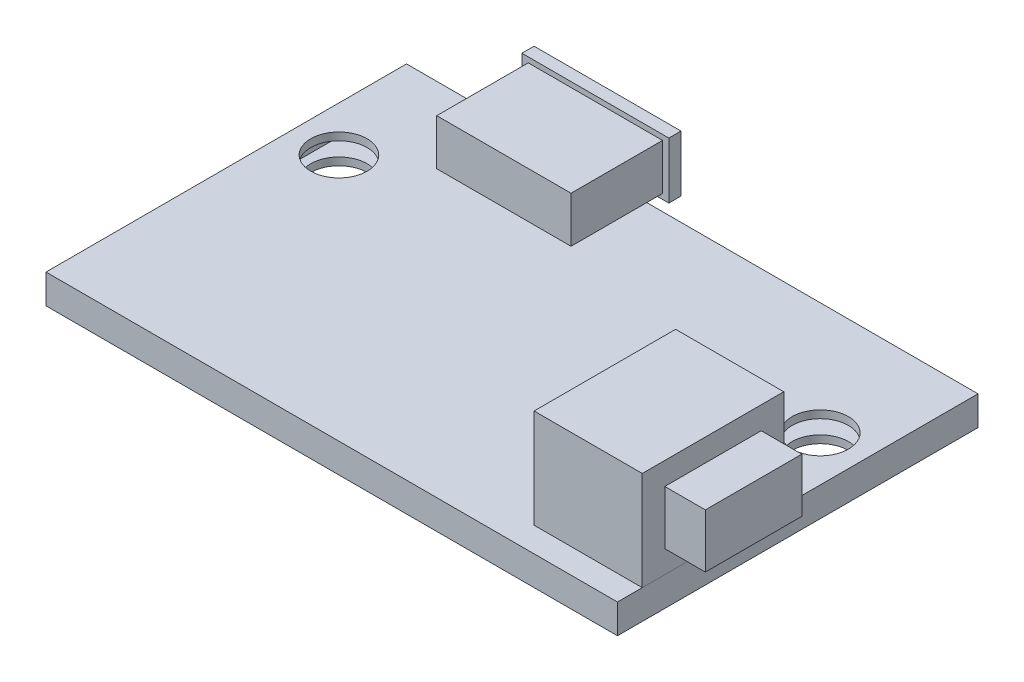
ISO-10303-21;
HEADER;
FILE_DESCRIPTION(('STEP AP214'),'2;1');
FILE_NAME('part.step','',(''),(''),'','','');
FILE_SCHEMA(('AUTOMOTIVE_DESIGN { 1 0 10303 214 1 1 1 1 }'));
ENDSEC;
DATA;
#1=APPLICATION_CONTEXT('core data for automotive mechanical design processes');
#2=APPLICATION_PROTOCOL_DEFINITION('international standard','automotive_design',2000,#1);
#3=PRODUCT_CONTEXT('',#1,'mechanical');
#4=PRODUCT('Part','Part','',(#3));
#5=PRODUCT_RELATED_PRODUCT_CATEGORY('part','',(#4));
#6=PRODUCT_DEFINITION_FORMATION('','',#4);
#7=PRODUCT_DEFINITION_CONTEXT('part definition',#1,'design');
#8=PRODUCT_DEFINITION('design','',#6,#7);
#9=PRODUCT_DEFINITION_SHAPE('','',#8);
#10=(LENGTH_UNIT() NAMED_UNIT(*) SI_UNIT(.MILLI.,.METRE.));
#11=(NAMED_UNIT(*) PLANE_ANGLE_UNIT() SI_UNIT($,.RADIAN.));
#12=(NAMED_UNIT(*) SI_UNIT($,.STERADIAN.) SOLID_ANGLE_UNIT());
#13=UNCERTAINTY_MEASURE_WITH_UNIT(LENGTH_MEASURE(1.E-05),#10,'distance_accuracy_value','');
#14=(GEOMETRIC_REPRESENTATION_CONTEXT(3) GLOBAL_UNCERTAINTY_ASSIGNED_CONTEXT((#13)) GLOBAL_UNIT_ASSIGNED_CONTEXT((#10,
#11,#12)) REPRESENTATION_CONTEXT('',''));
#15=CARTESIAN_POINT('',(0.,0.,0.));
#16=DIRECTION('',(0.,0.,1.));
#17=DIRECTION('',(1.,0.,0.));
#18=AXIS2_PLACEMENT_3D('',#15,#16,#17);
#19=CARTESIAN_POINT('',(18.3896,4.3053,7.493));
#20=DIRECTION('',(0.,0.,-1.));
#21=DIRECTION('',(-1.,0.,0.));
#22=AXIS2_PLACEMENT_3D('',#19,#20,#21);
#23=PLANE('',#22);
#24=DIRECTION('',(0.,-1.,0.));
#25=VECTOR('',#24,1.);
#26=CARTESIAN_POINT('',(11.2776,4.3053,7.493));
#27=LINE('',#26,#25);
#28=CARTESIAN_POINT('',(11.2776,4.3053,7.493));
#29=VERTEX_POINT('',#28);
#30=CARTESIAN_POINT('',(11.2776,1.27,7.493));
#31=VERTEX_POINT('',#30);
#32=EDGE_CURVE('E109',#29,#31,#27,.T.);
#33=ORIENTED_EDGE('',*,*,#32,.T.);
#34=DIRECTION('',(-1.,0.,0.));
#35=VECTOR('',#34,1.);
#36=CARTESIAN_POINT('',(18.3896,1.27,7.493));
#37=LINE('',#36,#35);
#38=CARTESIAN_POINT('',(18.3896,1.27,7.493));
#39=VERTEX_POINT('',#38);
#40=EDGE_CURVE('E12',#39,#31,#37,.T.);
#41=ORIENTED_EDGE('',*,*,#40,.F.);
#42=DIRECTION('',(0.,-1.,0.));
#43=VECTOR('',#42,1.);
#44=CARTESIAN_POINT('',(18.3896,4.3053,7.493));
#45=LINE('',#44,#43);
#46=CARTESIAN_POINT('',(18.3896,4.3053,7.493));
#47=VERTEX_POINT('',#46);
#48=EDGE_CURVE('E97',#47,#39,#45,.T.);
#49=ORIENTED_EDGE('',*,*,#48,.F.);
#50=DIRECTION('',(-1.,0.,0.));
#51=VECTOR('',#50,1.);
#52=CARTESIAN_POINT('',(18.3896,4.3053,7.493));
#53=LINE('',#52,#51);
#54=EDGE_CURVE('E105',#47,#29,#53,.T.);
#55=ORIENTED_EDGE('',*,*,#54,.T.);
#56=EDGE_LOOP('',(#33,#41,#49,#55));
#57=FACE_BOUND('',#56,.T.);
#58=ADVANCED_FACE('F46',(#57),#23,.F.);
#59=CARTESIAN_POINT('',(18.3896,1.27,7.493));
#60=DIRECTION('',(0.,1.,0.));
#61=DIRECTION('',(0.,0.,1.));
#62=AXIS2_PLACEMENT_3D('',#59,#60,#61);
#63=PLANE('',#62);
#64=DIRECTION('',(0.,0.,-1.));
#65=VECTOR('',#64,1.);
#66=CARTESIAN_POINT('',(11.2776,1.27,7.493));
#67=LINE('',#66,#65);
#68=CARTESIAN_POINT('',(11.2776,1.27,2.0574));
#69=VERTEX_POINT('',#68);
#70=EDGE_CURVE('E101',#31,#69,#67,.T.);
#71=ORIENTED_EDGE('',*,*,#70,.T.);
#72=DIRECTION('',(-1.,0.,0.));
#73=VECTOR('',#72,1.);
#74=CARTESIAN_POINT('',(18.3896,1.27,2.0574));
#75=LINE('',#74,#73);
#76=CARTESIAN_POINT('',(18.3896,1.27,2.0574));
#77=VERTEX_POINT('',#76);
#78=EDGE_CURVE('E54',#77,#69,#75,.T.);
#79=ORIENTED_EDGE('',*,*,#78,.F.);
#80=DIRECTION('',(0.,0.,-1.));
#81=VECTOR('',#80,1.);
#82=CARTESIAN_POINT('',(18.3896,1.27,7.493));
#83=LINE('',#82,#81);
#84=EDGE_CURVE('E92',#39,#77,#83,.T.);
#85=ORIENTED_EDGE('',*,*,#84,.F.);
#86=ORIENTED_EDGE('',*,*,#40,.T.);
#87=EDGE_LOOP('',(#71,#79,#85,#86));
#88=FACE_BOUND('',#87,.T.);
#89=ADVANCED_FACE('F100',(#88),#63,.F.);
#90=CARTESIAN_POINT('',(18.3896,1.27,2.0574));
#91=DIRECTION('',(0.,0.,1.));
#92=DIRECTION('',(1.,0.,0.));
#93=AXIS2_PLACEMENT_3D('',#90,#91,#92);
#94=PLANE('',#93);
#95=DIRECTION('',(0.,1.,0.));
#96=VECTOR('',#95,1.);
#97=CARTESIAN_POINT('',(11.2776,1.27,2.0574));
#98=LINE('',#97,#96);
#99=CARTESIAN_POINT('',(11.2776,4.3053,2.0574));
#100=VERTEX_POINT('',#99);
#101=EDGE_CURVE('E79',#69,#100,#98,.T.);
#102=ORIENTED_EDGE('',*,*,#101,.T.);
#103=DIRECTION('',(-1.,0.,0.));
#104=VECTOR('',#103,1.);
#105=CARTESIAN_POINT('',(18.3896,4.3053,2.0574));
#106=LINE('',#105,#104);
#107=CARTESIAN_POINT('',(18.3896,4.3053,2.0574));
#108=VERTEX_POINT('',#107);
#109=EDGE_CURVE('E102',#108,#100,#106,.T.);
#110=ORIENTED_EDGE('',*,*,#109,.F.);
#111=DIRECTION('',(0.,1.,0.));
#112=VECTOR('',#111,1.);
#113=CARTESIAN_POINT('',(18.3896,1.27,2.0574));
#114=LINE('',#113,#112);
#115=EDGE_CURVE('E95',#77,#108,#114,.T.);
#116=ORIENTED_EDGE('',*,*,#115,.F.);
#117=ORIENTED_EDGE('',*,*,#78,.T.);
#118=EDGE_LOOP('',(#102,#110,#116,#117));
#119=FACE_BOUND('',#118,.T.);
#120=ADVANCED_FACE('F103',(#119),#94,.F.);
#121=CARTESIAN_POINT('',(18.3896,4.3053,2.0574));
#122=DIRECTION('',(0.,-1.,0.));
#123=DIRECTION('',(0.,0.,-1.));
#124=AXIS2_PLACEMENT_3D('',#121,#122,#123);
#125=PLANE('',#124);
#126=DIRECTION('',(0.,0.,1.));
#127=VECTOR('',#126,1.);
#128=CARTESIAN_POINT('',(11.2776,4.3053,2.0574));
#129=LINE('',#128,#127);
#130=EDGE_CURVE('E85',#100,#29,#129,.T.);
#131=ORIENTED_EDGE('',*,*,#130,.T.);
#132=ORIENTED_EDGE('',*,*,#54,.F.);
#133=DIRECTION('',(0.,0.,1.));
#134=VECTOR('',#133,1.);
#135=CARTESIAN_POINT('',(18.3896,4.3053,2.0574));
#136=LINE('',#135,#134);
#137=EDGE_CURVE('E62',#108,#47,#136,.T.);
#138=ORIENTED_EDGE('',*,*,#137,.F.);
#139=ORIENTED_EDGE('',*,*,#109,.T.);
#140=EDGE_LOOP('',(#131,#132,#138,#139));
#141=FACE_BOUND('',#140,.T.);
#142=ADVANCED_FACE('F116',(#141),#125,.F.);
#143=CARTESIAN_POINT('',(18.3896,0.,0.));
#144=DIRECTION('',(1.,0.,0.));
#145=DIRECTION('',(0.,0.,-1.));
#146=AXIS2_PLACEMENT_3D('',#143,#144,#145);
#147=PLANE('',#146);
#148=ORIENTED_EDGE('',*,*,#48,.T.);
#149=ORIENTED_EDGE('',*,*,#84,.T.);
#150=ORIENTED_EDGE('',*,*,#115,.T.);
#151=ORIENTED_EDGE('',*,*,#137,.T.);
#152=EDGE_LOOP('',(#148,#149,#150,#151));
#153=FACE_BOUND('',#152,.T.);
#154=ADVANCED_FACE('F93',(#153),#147,.T.);
#155=CARTESIAN_POINT('',(11.2776,0.,0.));
#156=DIRECTION('',(1.,0.,0.));
#157=DIRECTION('',(0.,0.,-1.));
#158=AXIS2_PLACEMENT_3D('',#155,#156,#157);
#159=PLANE('',#158);
#160=ORIENTED_EDGE('',*,*,#32,.F.);
#161=ORIENTED_EDGE('',*,*,#130,.F.);
#162=ORIENTED_EDGE('',*,*,#101,.F.);
#163=ORIENTED_EDGE('',*,*,#70,.F.);
#164=EDGE_LOOP('',(#160,#161,#162,#163));
#165=FACE_BOUND('',#164,.T.);
#166=ADVANCED_FACE('F119',(#165),#159,.F.);
#167=CLOSED_SHELL('',(#58,#89,#120,#142,#154,#166));
#168=MANIFOLD_SOLID_BREP('B2',#167);
#169=CARTESIAN_POINT('',(16.1036,5.5753,8.763));
#170=DIRECTION('',(-1.,0.,0.));
#171=DIRECTION('',(0.,0.,1.));
#172=AXIS2_PLACEMENT_3D('',#169,#170,#171);
#173=PLANE('',#172);
#174=DIRECTION('',(0.,0.,-1.));
#175=VECTOR('',#174,1.);
#176=CARTESIAN_POINT('',(16.1036,0.,8.763));
#177=LINE('',#176,#175);
#178=CARTESIAN_POINT('',(16.1036,0.,8.763));
#179=VERTEX_POINT('',#178);
#180=CARTESIAN_POINT('',(16.1036,0.,0.787400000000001));
#181=VERTEX_POINT('',#180);
#182=EDGE_CURVE('E306',#179,#181,#177,.T.);
#183=ORIENTED_EDGE('',*,*,#182,.T.);
#184=DIRECTION('',(0.,-1.,0.));
#185=VECTOR('',#184,1.);
#186=CARTESIAN_POINT('',(16.1036,5.5753,0.787400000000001));
#187=LINE('',#186,#185);
#188=CARTESIAN_POINT('',(16.1036,5.5753,0.787400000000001));
#189=VERTEX_POINT('',#188);
#190=EDGE_CURVE('E310',#189,#181,#187,.T.);
#191=ORIENTED_EDGE('',*,*,#190,.F.);
#192=DIRECTION('',(0.,0.,-1.));
#193=VECTOR('',#192,1.);
#194=CARTESIAN_POINT('',(16.1036,5.5753,8.763));
#195=LINE('',#194,#193);
#196=CARTESIAN_POINT('',(16.1036,5.5753,8.763));
#197=VERTEX_POINT('',#196);
#198=EDGE_CURVE('E298',#197,#189,#195,.T.);
#199=ORIENTED_EDGE('',*,*,#198,.F.);
#200=DIRECTION('',(0.,-1.,0.));
#201=VECTOR('',#200,1.);
#202=CARTESIAN_POINT('',(16.1036,5.5753,8.763));
#203=LINE('',#202,#201);
#204=EDGE_CURVE('E187',#197,#179,#203,.T.);
#205=ORIENTED_EDGE('',*,*,#204,.T.);
#206=EDGE_LOOP('',(#183,#191,#199,#205));
#207=FACE_BOUND('',#206,.T.);
#208=DIRECTION('',(0.,0.,-1.));
#209=VECTOR('',#208,1.);
#210=CARTESIAN_POINT('',(16.1036,1.27,8.763));
#211=LINE('',#210,#209);
#212=CARTESIAN_POINT('',(16.1036,1.27,7.493));
#213=VERTEX_POINT('',#212);
#214=CARTESIAN_POINT('',(16.1036,1.27,2.0574));
#215=VERTEX_POINT('',#214);
#216=EDGE_CURVE('E263',#213,#215,#211,.T.);
#217=ORIENTED_EDGE('',*,*,#216,.F.);
#218=DIRECTION('',(0.,-1.,0.));
#219=VECTOR('',#218,1.);
#220=CARTESIAN_POINT('',(16.1036,5.5753,7.493));
#221=LINE('',#220,#219);
#222=CARTESIAN_POINT('',(16.1036,4.3053,7.493));
#223=VERTEX_POINT('',#222);
#224=EDGE_CURVE('E259',#223,#213,#221,.T.);
#225=ORIENTED_EDGE('',*,*,#224,.F.);
#226=DIRECTION('',(0.,0.,-1.));
#227=VECTOR('',#226,1.);
#228=CARTESIAN_POINT('',(16.1036,4.3053,8.763));
#229=LINE('',#228,#227);
#230=CARTESIAN_POINT('',(16.1036,4.3053,2.0574));
#231=VERTEX_POINT('',#230);
#232=EDGE_CURVE('E194',#223,#231,#229,.T.);
#233=ORIENTED_EDGE('',*,*,#232,.T.);
#234=DIRECTION('',(0.,-1.,0.));
#235=VECTOR('',#234,1.);
#236=CARTESIAN_POINT('',(16.1036,5.5753,2.0574));
#237=LINE('',#236,#235);
#238=EDGE_CURVE('E284',#231,#215,#237,.T.);
#239=ORIENTED_EDGE('',*,*,#238,.T.);
#240=EDGE_LOOP('',(#217,#225,#233,#239));
#241=FACE_BOUND('',#240,.T.);
#242=ADVANCED_FACE('F179',(#207,#241),#173,.F.);
#243=CARTESIAN_POINT('',(10.0076,5.5753,8.763));
#244=DIRECTION('',(1.,0.,0.));
#245=DIRECTION('',(0.,0.,-1.));
#246=AXIS2_PLACEMENT_3D('',#243,#244,#245);
#247=PLANE('',#246);
#248=DIRECTION('',(0.,0.,1.));
#249=VECTOR('',#248,1.);
#250=CARTESIAN_POINT('',(10.0076,0.,8.763));
#251=LINE('',#250,#249);
#252=CARTESIAN_POINT('',(10.0076,0.,0.787400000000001));
#253=VERTEX_POINT('',#252);
#254=CARTESIAN_POINT('',(10.0076,0.,8.763));
#255=VERTEX_POINT('',#254);
#256=EDGE_CURVE('E273',#253,#255,#251,.T.);
#257=ORIENTED_EDGE('',*,*,#256,.T.);
#258=DIRECTION('',(0.,-1.,0.));
#259=VECTOR('',#258,1.);
#260=CARTESIAN_POINT('',(10.0076,5.5753,8.763));
#261=LINE('',#260,#259);
#262=CARTESIAN_POINT('',(10.0076,5.5753,8.763));
#263=VERTEX_POINT('',#262);
#264=EDGE_CURVE('E44',#263,#255,#261,.T.);
#265=ORIENTED_EDGE('',*,*,#264,.F.);
#266=DIRECTION('',(0.,0.,1.));
#267=VECTOR('',#266,1.);
#268=CARTESIAN_POINT('',(10.0076,5.5753,8.763));
#269=LINE('',#268,#267);
#270=CARTESIAN_POINT('',(10.0076,5.5753,0.787400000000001));
#271=VERTEX_POINT('',#270);
#272=EDGE_CURVE('E295',#271,#263,#269,.T.);
#273=ORIENTED_EDGE('',*,*,#272,.F.);
#274=DIRECTION('',(0.,-1.,0.));
#275=VECTOR('',#274,1.);
#276=CARTESIAN_POINT('',(10.0076,5.5753,0.787400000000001));
#277=LINE('',#276,#275);
#278=EDGE_CURVE('E301',#271,#253,#277,.T.);
#279=ORIENTED_EDGE('',*,*,#278,.T.);
#280=EDGE_LOOP('',(#257,#265,#273,#279));
#281=FACE_BOUND('',#280,.T.);
#282=ADVANCED_FACE('F181',(#281),#247,.F.);
#283=CARTESIAN_POINT('',(16.1036,5.5753,8.763));
#284=DIRECTION('',(0.,0.,-1.));
#285=DIRECTION('',(-1.,0.,0.));
#286=AXIS2_PLACEMENT_3D('',#283,#284,#285);
#287=PLANE('',#286);
#288=DIRECTION('',(1.,0.,0.));
#289=VECTOR('',#288,1.);
#290=CARTESIAN_POINT('',(16.1036,0.,8.763));
#291=LINE('',#290,#289);
#292=EDGE_CURVE('E304',#255,#179,#291,.T.);
#293=ORIENTED_EDGE('',*,*,#292,.T.);
#294=ORIENTED_EDGE('',*,*,#204,.F.);
#295=DIRECTION('',(1.,0.,0.));
#296=VECTOR('',#295,1.);
#297=CARTESIAN_POINT('',(16.1036,5.5753,8.763));
#298=LINE('',#297,#296);
#299=EDGE_CURVE('E231',#263,#197,#298,.T.);
#300=ORIENTED_EDGE('',*,*,#299,.F.);
#301=ORIENTED_EDGE('',*,*,#264,.T.);
#302=EDGE_LOOP('',(#293,#294,#300,#301));
#303=FACE_BOUND('',#302,.T.);
#304=ADVANCED_FACE('F326',(#303),#287,.F.);
#305=CARTESIAN_POINT('',(16.1036,5.5753,0.787400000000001));
#306=DIRECTION('',(0.,0.,1.));
#307=DIRECTION('',(1.,0.,0.));
#308=AXIS2_PLACEMENT_3D('',#305,#306,#307);
#309=PLANE('',#308);
#310=DIRECTION('',(-1.,0.,0.));
#311=VECTOR('',#310,1.);
#312=CARTESIAN_POINT('',(16.1036,0.,0.787400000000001));
#313=LINE('',#312,#311);
#314=EDGE_CURVE('E224',#181,#253,#313,.T.);
#315=ORIENTED_EDGE('',*,*,#314,.T.);
#316=ORIENTED_EDGE('',*,*,#278,.F.);
#317=DIRECTION('',(-1.,0.,0.));
#318=VECTOR('',#317,1.);
#319=CARTESIAN_POINT('',(16.1036,5.5753,0.787400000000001));
#320=LINE('',#319,#318);
#321=EDGE_CURVE('E203',#189,#271,#320,.T.);
#322=ORIENTED_EDGE('',*,*,#321,.F.);
#323=ORIENTED_EDGE('',*,*,#190,.T.);
#324=EDGE_LOOP('',(#315,#316,#322,#323));
#325=FACE_BOUND('',#324,.T.);
#326=ADVANCED_FACE('F323',(#325),#309,.F.);
#327=CARTESIAN_POINT('',(0.,5.5753,0.));
#328=DIRECTION('',(0.,1.,0.));
#329=DIRECTION('',(0.,0.,1.));
#330=AXIS2_PLACEMENT_3D('',#327,#328,#329);
#331=PLANE('',#330);
#332=ORIENTED_EDGE('',*,*,#272,.T.);
#333=ORIENTED_EDGE('',*,*,#299,.T.);
#334=ORIENTED_EDGE('',*,*,#198,.T.);
#335=ORIENTED_EDGE('',*,*,#321,.T.);
#336=EDGE_LOOP('',(#332,#333,#334,#335));
#337=FACE_BOUND('',#336,.T.);
#338=ADVANCED_FACE('F325',(#337),#331,.T.);
#339=CARTESIAN_POINT('',(0.,0.,0.));
#340=DIRECTION('',(0.,1.,0.));
#341=DIRECTION('',(0.,0.,1.));
#342=AXIS2_PLACEMENT_3D('',#339,#340,#341);
#343=PLANE('',#342);
#344=ORIENTED_EDGE('',*,*,#256,.F.);
#345=ORIENTED_EDGE('',*,*,#314,.F.);
#346=ORIENTED_EDGE('',*,*,#182,.F.);
#347=ORIENTED_EDGE('',*,*,#292,.F.);
#348=EDGE_LOOP('',(#344,#345,#346,#347));
#349=FACE_BOUND('',#348,.T.);
#350=ADVANCED_FACE('F319',(#349),#343,.F.);
#351=CARTESIAN_POINT('',(11.2776,5.5753,8.763));
#352=DIRECTION('',(1.,0.,0.));
#353=DIRECTION('',(0.,0.,-1.));
#354=AXIS2_PLACEMENT_3D('',#351,#352,#353);
#355=PLANE('',#354);
#356=DIRECTION('',(0.,0.,1.));
#357=VECTOR('',#356,1.);
#358=CARTESIAN_POINT('',(11.2776,1.27,8.763));
#359=LINE('',#358,#357);
#360=CARTESIAN_POINT('',(11.2776,1.27,2.0574));
#361=VERTEX_POINT('',#360);
#362=CARTESIAN_POINT('',(11.2776,1.27,7.493));
#363=VERTEX_POINT('',#362);
#364=EDGE_CURVE('E264',#361,#363,#359,.T.);
#365=ORIENTED_EDGE('',*,*,#364,.F.);
#366=DIRECTION('',(0.,-1.,0.));
#367=VECTOR('',#366,1.);
#368=CARTESIAN_POINT('',(11.2776,5.5753,2.0574));
#369=LINE('',#368,#367);
#370=CARTESIAN_POINT('',(11.2776,4.3053,2.0574));
#371=VERTEX_POINT('',#370);
#372=EDGE_CURVE('E283',#371,#361,#369,.T.);
#373=ORIENTED_EDGE('',*,*,#372,.F.);
#374=DIRECTION('',(0.,0.,1.));
#375=VECTOR('',#374,1.);
#376=CARTESIAN_POINT('',(11.2776,4.3053,8.763));
#377=LINE('',#376,#375);
#378=CARTESIAN_POINT('',(11.2776,4.3053,7.493));
#379=VERTEX_POINT('',#378);
#380=EDGE_CURVE('E272',#371,#379,#377,.T.);
#381=ORIENTED_EDGE('',*,*,#380,.T.);
#382=DIRECTION('',(0.,-1.,0.));
#383=VECTOR('',#382,1.);
#384=CARTESIAN_POINT('',(11.2776,5.5753,7.493));
#385=LINE('',#384,#383);
#386=EDGE_CURVE('E257',#379,#363,#385,.T.);
#387=ORIENTED_EDGE('',*,*,#386,.T.);
#388=EDGE_LOOP('',(#365,#373,#381,#387));
#389=FACE_BOUND('',#388,.T.);
#390=ADVANCED_FACE('F269',(#389),#355,.T.);
#391=CARTESIAN_POINT('',(16.1036,5.5753,7.493));
#392=DIRECTION('',(0.,0.,-1.));
#393=DIRECTION('',(-1.,0.,0.));
#394=AXIS2_PLACEMENT_3D('',#391,#392,#393);
#395=PLANE('',#394);
#396=DIRECTION('',(1.,0.,0.));
#397=VECTOR('',#396,1.);
#398=CARTESIAN_POINT('',(16.1036,1.27,7.493));
#399=LINE('',#398,#397);
#400=EDGE_CURVE('E254',#363,#213,#399,.T.);
#401=ORIENTED_EDGE('',*,*,#400,.F.);
#402=ORIENTED_EDGE('',*,*,#386,.F.);
#403=DIRECTION('',(1.,0.,0.));
#404=VECTOR('',#403,1.);
#405=CARTESIAN_POINT('',(16.1036,4.3053,7.493));
#406=LINE('',#405,#404);
#407=EDGE_CURVE('E282',#379,#223,#406,.T.);
#408=ORIENTED_EDGE('',*,*,#407,.T.);
#409=ORIENTED_EDGE('',*,*,#224,.T.);
#410=EDGE_LOOP('',(#401,#402,#408,#409));
#411=FACE_BOUND('',#410,.T.);
#412=ADVANCED_FACE('F256',(#411),#395,.T.);
#413=CARTESIAN_POINT('',(16.1036,5.5753,2.0574));
#414=DIRECTION('',(0.,0.,1.));
#415=DIRECTION('',(1.,0.,0.));
#416=AXIS2_PLACEMENT_3D('',#413,#414,#415);
#417=PLANE('',#416);
#418=DIRECTION('',(-1.,0.,0.));
#419=VECTOR('',#418,1.);
#420=CARTESIAN_POINT('',(16.1036,1.27,2.0574));
#421=LINE('',#420,#419);
#422=EDGE_CURVE('E277',#215,#361,#421,.T.);
#423=ORIENTED_EDGE('',*,*,#422,.F.);
#424=ORIENTED_EDGE('',*,*,#238,.F.);
#425=DIRECTION('',(-1.,0.,0.));
#426=VECTOR('',#425,1.);
#427=CARTESIAN_POINT('',(16.1036,4.3053,2.0574));
#428=LINE('',#427,#426);
#429=EDGE_CURVE('E285',#231,#371,#428,.T.);
#430=ORIENTED_EDGE('',*,*,#429,.T.);
#431=ORIENTED_EDGE('',*,*,#372,.T.);
#432=EDGE_LOOP('',(#423,#424,#430,#431));
#433=FACE_BOUND('',#432,.T.);
#434=ADVANCED_FACE('F383',(#433),#417,.T.);
#435=CARTESIAN_POINT('',(0.,4.3053,0.));
#436=DIRECTION('',(0.,1.,0.));
#437=DIRECTION('',(0.,0.,1.));
#438=AXIS2_PLACEMENT_3D('',#435,#436,#437);
#439=PLANE('',#438);
#440=ORIENTED_EDGE('',*,*,#380,.F.);
#441=ORIENTED_EDGE('',*,*,#429,.F.);
#442=ORIENTED_EDGE('',*,*,#232,.F.);
#443=ORIENTED_EDGE('',*,*,#407,.F.);
#444=EDGE_LOOP('',(#440,#441,#442,#443));
#445=FACE_BOUND('',#444,.T.);
#446=ADVANCED_FACE('F392',(#445),#439,.F.);
#447=CARTESIAN_POINT('',(0.,1.27,0.));
#448=DIRECTION('',(0.,1.,0.));
#449=DIRECTION('',(0.,0.,1.));
#450=AXIS2_PLACEMENT_3D('',#447,#448,#449);
#451=PLANE('',#450);
#452=ORIENTED_EDGE('',*,*,#364,.T.);
#453=ORIENTED_EDGE('',*,*,#400,.T.);
#454=ORIENTED_EDGE('',*,*,#216,.T.);
#455=ORIENTED_EDGE('',*,*,#422,.T.);
#456=EDGE_LOOP('',(#452,#453,#454,#455));
#457=FACE_BOUND('',#456,.T.);
#458=ADVANCED_FACE('F275',(#457),#451,.T.);
#459=CLOSED_SHELL('',(#242,#282,#304,#326,#338,#350,#390,#412,#434,#446,#458));
#460=MANIFOLD_SOLID_BREP('B6',#459);
#461=CARTESIAN_POINT('',(0.,0.,-11.7348));
#462=DIRECTION('',(0.,0.,1.));
#463=DIRECTION('',(1.,0.,0.));
#464=AXIS2_PLACEMENT_3D('',#461,#462,#463);
#465=PLANE('',#464);
#466=DIRECTION('',(0.,1.,0.));
#467=VECTOR('',#466,1.);
#468=CARTESIAN_POINT('',(-10.4902,-0.2921,-11.7348));
#469=LINE('',#468,#467);
#470=CARTESIAN_POINT('',(-10.4902,-0.2921,-11.7348));
#471=VERTEX_POINT('',#470);
#472=CARTESIAN_POINT('',(-10.4902,2.8829,-11.7348));
#473=VERTEX_POINT('',#472);
#474=EDGE_CURVE('E721',#471,#473,#469,.T.);
#475=ORIENTED_EDGE('',*,*,#474,.T.);
#476=DIRECTION('',(1.,0.,0.));
#477=VECTOR('',#476,1.);
#478=CARTESIAN_POINT('',(-2.2098,2.8829,-11.7348));
#479=LINE('',#478,#477);
#480=CARTESIAN_POINT('',(-2.2098,2.8829,-11.7348));
#481=VERTEX_POINT('',#480);
#482=EDGE_CURVE('E724',#473,#481,#479,.T.);
#483=ORIENTED_EDGE('',*,*,#482,.T.);
#484=DIRECTION('',(0.,-1.,0.));
#485=VECTOR('',#484,1.);
#486=CARTESIAN_POINT('',(-2.2098,-0.2921,-11.7348));
#487=LINE('',#486,#485);
#488=CARTESIAN_POINT('',(-2.2098,-0.2921,-11.7348));
#489=VERTEX_POINT('',#488);
#490=EDGE_CURVE('E727',#481,#489,#487,.T.);
#491=ORIENTED_EDGE('',*,*,#490,.T.);
#492=DIRECTION('',(-1.,0.,0.));
#493=VECTOR('',#492,1.);
#494=CARTESIAN_POINT('',(-2.2098,-0.2921,-11.7348));
#495=LINE('',#494,#493);
#496=EDGE_CURVE('E729',#489,#471,#495,.T.);
#497=ORIENTED_EDGE('',*,*,#496,.T.);
#498=EDGE_LOOP('',(#475,#483,#491,#497));
#499=FACE_BOUND('',#498,.T.);
#500=DIRECTION('',(0.,1.,0.));
#501=VECTOR('',#500,1.);
#502=CARTESIAN_POINT('',(-10.0584,0.,-11.7348));
#503=LINE('',#502,#501);
#504=CARTESIAN_POINT('',(-10.0584,0.1397,-11.7348));
#505=VERTEX_POINT('',#504);
#506=CARTESIAN_POINT('',(-10.0584,2.4511,-11.7348));
#507=VERTEX_POINT('',#506);
#508=EDGE_CURVE('E696',#505,#507,#503,.T.);
#509=ORIENTED_EDGE('',*,*,#508,.F.);
#510=DIRECTION('',(-1.,0.,0.));
#511=VECTOR('',#510,1.);
#512=CARTESIAN_POINT('',(0.,0.1397,-11.7348));
#513=LINE('',#512,#511);
#514=CARTESIAN_POINT('',(-2.6416,0.1397,-11.7348));
#515=VERTEX_POINT('',#514);
#516=EDGE_CURVE('E706',#515,#505,#513,.T.);
#517=ORIENTED_EDGE('',*,*,#516,.F.);
#518=DIRECTION('',(0.,-1.,0.));
#519=VECTOR('',#518,1.);
#520=CARTESIAN_POINT('',(-2.6416,0.,-11.7348));
#521=LINE('',#520,#519);
#522=CARTESIAN_POINT('',(-2.6416,2.4511,-11.7348));
#523=VERTEX_POINT('',#522);
#524=EDGE_CURVE('E718',#523,#515,#521,.T.);
#525=ORIENTED_EDGE('',*,*,#524,.F.);
#526=DIRECTION('',(1.,0.,0.));
#527=VECTOR('',#526,1.);
#528=CARTESIAN_POINT('',(0.,2.4511,-11.7348));
#529=LINE('',#528,#527);
#530=EDGE_CURVE('E716',#507,#523,#529,.T.);
#531=ORIENTED_EDGE('',*,*,#530,.F.);
#532=EDGE_LOOP('',(#509,#517,#525,#531));
#533=FACE_BOUND('',#532,.T.);
#534=ADVANCED_FACE('F418',(#499,#533),#465,.F.);
#535=CARTESIAN_POINT('',(0.,0.,0.));
#536=DIRECTION('',(0.,-1.,0.));
#537=DIRECTION('',(0.,0.,-1.));
#538=AXIS2_PLACEMENT_3D('',#535,#536,#537);
#539=PLANE('',#538);
#540=CARTESIAN_POINT('',(13.5636,0.,-3.81));
#541=DIRECTION('',(0.,1.,0.));
#542=DIRECTION('',(0.,0.,1.));
#543=AXIS2_PLACEMENT_3D('',#540,#541,#542);
#544=CIRCLE('',#543,1.5875);
#545=CARTESIAN_POINT('',(13.5636,0.,-2.2225));
#546=VERTEX_POINT('',#545);
#547=EDGE_CURVE('E821',#546,#546,#544,.T.);
#548=ORIENTED_EDGE('',*,*,#547,.F.);
#549=EDGE_LOOP('',(#548));
#550=FACE_BOUND('',#549,.T.);
#551=CARTESIAN_POINT('',(-13.5636,0.,-3.81));
#552=DIRECTION('',(0.,1.,0.));
#553=DIRECTION('',(0.,0.,1.));
#554=AXIS2_PLACEMENT_3D('',#551,#552,#553);
#555=CIRCLE('',#554,1.5875);
#556=CARTESIAN_POINT('',(-13.5636,0.,-2.2225));
#557=VERTEX_POINT('',#556);
#558=EDGE_CURVE('E831',#557,#557,#555,.T.);
#559=ORIENTED_EDGE('',*,*,#558,.F.);
#560=EDGE_LOOP('',(#559));
#561=FACE_BOUND('',#560,.T.);
#562=DIRECTION('',(0.,0.,1.));
#563=VECTOR('',#562,1.);
#564=CARTESIAN_POINT('',(-10.1346,0.,-5.8928));
#565=LINE('',#564,#563);
#566=CARTESIAN_POINT('',(-10.1346,0.,-10.16));
#567=VERTEX_POINT('',#566);
#568=CARTESIAN_POINT('',(-10.1346,0.,-5.8928));
#569=VERTEX_POINT('',#568);
#570=EDGE_CURVE('E177',#567,#569,#565,.T.);
#571=ORIENTED_EDGE('',*,*,#570,.F.);
#572=DIRECTION('',(-1.,0.,0.));
#573=VECTOR('',#572,1.);
#574=CARTESIAN_POINT('',(-16.1036,0.,-10.16));
#575=LINE('',#574,#573);
#576=CARTESIAN_POINT('',(-16.1036,0.,-10.16));
#577=VERTEX_POINT('',#576);
#578=EDGE_CURVE('E796',#567,#577,#575,.T.);
#579=ORIENTED_EDGE('',*,*,#578,.T.);
#580=DIRECTION('',(0.,0.,1.));
#581=VECTOR('',#580,1.);
#582=CARTESIAN_POINT('',(-16.1036,0.,10.16));
#583=LINE('',#582,#581);
#584=CARTESIAN_POINT('',(-16.1036,0.,10.16));
#585=VERTEX_POINT('',#584);
#586=EDGE_CURVE('E800',#577,#585,#583,.T.);
#587=ORIENTED_EDGE('',*,*,#586,.T.);
#588=DIRECTION('',(1.,0.,0.));
#589=VECTOR('',#588,1.);
#590=CARTESIAN_POINT('',(-16.1036,0.,10.16));
#591=LINE('',#590,#589);
#592=CARTESIAN_POINT('',(16.1036,0.,10.16));
#593=VERTEX_POINT('',#592);
#594=EDGE_CURVE('E784',#585,#593,#591,.T.);
#595=ORIENTED_EDGE('',*,*,#594,.T.);
#596=DIRECTION('',(0.,0.,-1.));
#597=VECTOR('',#596,1.);
#598=CARTESIAN_POINT('',(16.1036,0.,10.16));
#599=LINE('',#598,#597);
#600=CARTESIAN_POINT('',(16.1036,0.,-10.16));
#601=VERTEX_POINT('',#600);
#602=EDGE_CURVE('E779',#593,#601,#599,.T.);
#603=ORIENTED_EDGE('',*,*,#602,.T.);
#604=CARTESIAN_POINT('',(-2.5654,0.,-10.16));
#605=VERTEX_POINT('',#604);
#606=EDGE_CURVE('E797',#601,#605,#575,.T.);
#607=ORIENTED_EDGE('',*,*,#606,.T.);
#608=DIRECTION('',(0.,0.,-1.));
#609=VECTOR('',#608,1.);
#610=CARTESIAN_POINT('',(-2.5654,0.,-5.8928));
#611=LINE('',#610,#609);
#612=CARTESIAN_POINT('',(-2.5654,0.,-5.8928));
#613=VERTEX_POINT('',#612);
#614=EDGE_CURVE('E764',#613,#605,#611,.T.);
#615=ORIENTED_EDGE('',*,*,#614,.F.);
#616=DIRECTION('',(1.,0.,0.));
#617=VECTOR('',#616,1.);
#618=CARTESIAN_POINT('',(-10.1346,0.,-5.8928));
#619=LINE('',#618,#617);
#620=EDGE_CURVE('E444',#569,#613,#619,.T.);
#621=ORIENTED_EDGE('',*,*,#620,.F.);
#622=EDGE_LOOP('',(#571,#579,#587,#595,#603,#607,#615,#621));
#623=FACE_BOUND('',#622,.T.);
#624=ADVANCED_FACE('F876',(#550,#561,#623),#539,.F.);
#625=CARTESIAN_POINT('',(16.1036,-1.651,10.16));
#626=DIRECTION('',(1.,0.,0.));
#627=DIRECTION('',(0.,0.,-1.));
#628=AXIS2_PLACEMENT_3D('',#625,#626,#627);
#629=PLANE('',#628);
#630=ORIENTED_EDGE('',*,*,#602,.F.);
#631=DIRECTION('',(0.,1.,0.));
#632=VECTOR('',#631,1.);
#633=CARTESIAN_POINT('',(16.1036,-1.651,10.16));
#634=LINE('',#633,#632);
#635=CARTESIAN_POINT('',(16.1036,-1.651,10.16));
#636=VERTEX_POINT('',#635);
#637=EDGE_CURVE('E427',#636,#593,#634,.T.);
#638=ORIENTED_EDGE('',*,*,#637,.F.);
#639=DIRECTION('',(0.,0.,-1.));
#640=VECTOR('',#639,1.);
#641=CARTESIAN_POINT('',(16.1036,-1.651,10.16));
#642=LINE('',#641,#640);
#643=CARTESIAN_POINT('',(16.1036,-1.651,-10.16));
#644=VERTEX_POINT('',#643);
#645=EDGE_CURVE('E780',#636,#644,#642,.T.);
#646=ORIENTED_EDGE('',*,*,#645,.T.);
#647=DIRECTION('',(0.,1.,0.));
#648=VECTOR('',#647,1.);
#649=CARTESIAN_POINT('',(16.1036,-1.651,-10.16));
#650=LINE('',#649,#648);
#651=EDGE_CURVE('E793',#644,#601,#650,.T.);
#652=ORIENTED_EDGE('',*,*,#651,.T.);
#653=EDGE_LOOP('',(#630,#638,#646,#652));
#654=FACE_BOUND('',#653,.T.);
#655=ADVANCED_FACE('F420',(#654),#629,.T.);
#656=CARTESIAN_POINT('',(-16.1036,-1.651,10.16));
#657=DIRECTION('',(0.,0.,1.));
#658=DIRECTION('',(1.,0.,0.));
#659=AXIS2_PLACEMENT_3D('',#656,#657,#658);
#660=PLANE('',#659);
#661=ORIENTED_EDGE('',*,*,#594,.F.);
#662=DIRECTION('',(0.,1.,0.));
#663=VECTOR('',#662,1.);
#664=CARTESIAN_POINT('',(-16.1036,-1.651,10.16));
#665=LINE('',#664,#663);
#666=CARTESIAN_POINT('',(-16.1036,-1.651,10.16));
#667=VERTEX_POINT('',#666);
#668=EDGE_CURVE('E807',#667,#585,#665,.T.);
#669=ORIENTED_EDGE('',*,*,#668,.F.);
#670=DIRECTION('',(1.,0.,0.));
#671=VECTOR('',#670,1.);
#672=CARTESIAN_POINT('',(-16.1036,-1.651,10.16));
#673=LINE('',#672,#671);
#674=EDGE_CURVE('E790',#667,#636,#673,.T.);
#675=ORIENTED_EDGE('',*,*,#674,.T.);
#676=ORIENTED_EDGE('',*,*,#637,.T.);
#677=EDGE_LOOP('',(#661,#669,#675,#676));
#678=FACE_BOUND('',#677,.T.);
#679=ADVANCED_FACE('F932',(#678),#660,.T.);
#680=CARTESIAN_POINT('',(-16.1036,-1.651,10.16));
#681=DIRECTION('',(-1.,0.,0.));
#682=DIRECTION('',(0.,0.,1.));
#683=AXIS2_PLACEMENT_3D('',#680,#681,#682);
#684=PLANE('',#683);
#685=ORIENTED_EDGE('',*,*,#586,.F.);
#686=DIRECTION('',(0.,1.,0.));
#687=VECTOR('',#686,1.);
#688=CARTESIAN_POINT('',(-16.1036,-1.651,-10.16));
#689=LINE('',#688,#687);
#690=CARTESIAN_POINT('',(-16.1036,-1.651,-10.16));
#691=VERTEX_POINT('',#690);
#692=EDGE_CURVE('E809',#691,#577,#689,.T.);
#693=ORIENTED_EDGE('',*,*,#692,.F.);
#694=DIRECTION('',(0.,0.,1.));
#695=VECTOR('',#694,1.);
#696=CARTESIAN_POINT('',(-16.1036,-1.651,10.16));
#697=LINE('',#696,#695);
#698=EDGE_CURVE('E787',#691,#667,#697,.T.);
#699=ORIENTED_EDGE('',*,*,#698,.T.);
#700=ORIENTED_EDGE('',*,*,#668,.T.);
#701=EDGE_LOOP('',(#685,#693,#699,#700));
#702=FACE_BOUND('',#701,.T.);
#703=ADVANCED_FACE('F935',(#702),#684,.T.);
#704=CARTESIAN_POINT('',(-16.1036,-1.651,-10.16));
#705=DIRECTION('',(0.,0.,-1.));
#706=DIRECTION('',(-1.,0.,0.));
#707=AXIS2_PLACEMENT_3D('',#704,#705,#706);
#708=PLANE('',#707);
#709=ORIENTED_EDGE('',*,*,#606,.F.);
#710=ORIENTED_EDGE('',*,*,#651,.F.);
#711=DIRECTION('',(-1.,0.,0.));
#712=VECTOR('',#711,1.);
#713=CARTESIAN_POINT('',(-16.1036,-1.651,-10.16));
#714=LINE('',#713,#712);
#715=EDGE_CURVE('E783',#644,#691,#714,.T.);
#716=ORIENTED_EDGE('',*,*,#715,.T.);
#717=ORIENTED_EDGE('',*,*,#692,.T.);
#718=ORIENTED_EDGE('',*,*,#578,.F.);
#719=EDGE_CURVE('E801',#605,#567,#575,.T.);
#720=ORIENTED_EDGE('',*,*,#719,.F.);
#721=EDGE_LOOP('',(#709,#710,#716,#717,#718,#720));
#722=FACE_BOUND('',#721,.T.);
#723=ADVANCED_FACE('F930',(#722),#708,.T.);
#724=CARTESIAN_POINT('',(0.,-1.651,0.));
#725=DIRECTION('',(0.,-1.,0.));
#726=DIRECTION('',(0.,0.,-1.));
#727=AXIS2_PLACEMENT_3D('',#724,#725,#726);
#728=PLANE('',#727);
#729=CARTESIAN_POINT('',(13.5636,-1.651,-3.81));
#730=DIRECTION('',(0.,1.,0.));
#731=DIRECTION('',(0.,0.,1.));
#732=AXIS2_PLACEMENT_3D('',#729,#730,#731);
#733=CIRCLE('',#732,1.5875);
#734=CARTESIAN_POINT('',(13.5636,-1.651,-2.2225));
#735=VERTEX_POINT('',#734);
#736=EDGE_CURVE('E815',#735,#735,#733,.T.);
#737=ORIENTED_EDGE('',*,*,#736,.T.);
#738=EDGE_LOOP('',(#737));
#739=FACE_BOUND('',#738,.T.);
#740=CARTESIAN_POINT('',(-13.5636,-1.651,-3.81));
#741=DIRECTION('',(0.,1.,0.));
#742=DIRECTION('',(0.,0.,1.));
#743=AXIS2_PLACEMENT_3D('',#740,#741,#742);
#744=CIRCLE('',#743,1.5875);
#745=CARTESIAN_POINT('',(-13.5636,-1.651,-2.2225));
#746=VERTEX_POINT('',#745);
#747=EDGE_CURVE('E826',#746,#746,#744,.T.);
#748=ORIENTED_EDGE('',*,*,#747,.T.);
#749=EDGE_LOOP('',(#748));
#750=FACE_BOUND('',#749,.T.);
#751=ORIENTED_EDGE('',*,*,#645,.F.);
#752=ORIENTED_EDGE('',*,*,#674,.F.);
#753=ORIENTED_EDGE('',*,*,#698,.F.);
#754=ORIENTED_EDGE('',*,*,#715,.F.);
#755=EDGE_LOOP('',(#751,#752,#753,#754));
#756=FACE_BOUND('',#755,.T.);
#757=ADVANCED_FACE('F927',(#739,#750,#756),#728,.T.);
#758=CARTESIAN_POINT('',(-10.1346,2.5908,-5.8928));
#759=DIRECTION('',(1.,0.,0.));
#760=DIRECTION('',(0.,0.,-1.));
#761=AXIS2_PLACEMENT_3D('',#758,#759,#760);
#762=PLANE('',#761);
#763=CARTESIAN_POINT('',(-10.1346,0.,-11.049));
#764=VERTEX_POINT('',#763);
#765=EDGE_CURVE('E429',#764,#567,#565,.T.);
#766=ORIENTED_EDGE('',*,*,#765,.T.);
#767=ORIENTED_EDGE('',*,*,#570,.T.);
#768=DIRECTION('',(0.,-1.,0.));
#769=VECTOR('',#768,1.);
#770=CARTESIAN_POINT('',(-10.1346,2.5908,-5.8928));
#771=LINE('',#770,#769);
#772=CARTESIAN_POINT('',(-10.1346,2.5908,-5.8928));
#773=VERTEX_POINT('',#772);
#774=EDGE_CURVE('E776',#773,#569,#771,.T.);
#775=ORIENTED_EDGE('',*,*,#774,.F.);
#776=DIRECTION('',(0.,0.,1.));
#777=VECTOR('',#776,1.);
#778=CARTESIAN_POINT('',(-10.1346,2.5908,-5.8928));
#779=LINE('',#778,#777);
#780=CARTESIAN_POINT('',(-10.1346,2.5908,-11.049));
#781=VERTEX_POINT('',#780);
#782=EDGE_CURVE('E750',#781,#773,#779,.T.);
#783=ORIENTED_EDGE('',*,*,#782,.F.);
#784=DIRECTION('',(0.,-1.,0.));
#785=VECTOR('',#784,1.);
#786=CARTESIAN_POINT('',(-10.1346,2.5908,-11.049));
#787=LINE('',#786,#785);
#788=EDGE_CURVE('E759',#781,#764,#787,.T.);
#789=ORIENTED_EDGE('',*,*,#788,.T.);
#790=EDGE_LOOP('',(#766,#767,#775,#783,#789));
#791=FACE_BOUND('',#790,.T.);
#792=ADVANCED_FACE('F923',(#791),#762,.F.);
#793=CARTESIAN_POINT('',(-10.1346,2.5908,-5.8928));
#794=DIRECTION('',(0.,0.,-1.));
#795=DIRECTION('',(-1.,0.,0.));
#796=AXIS2_PLACEMENT_3D('',#793,#794,#795);
#797=PLANE('',#796);
#798=ORIENTED_EDGE('',*,*,#620,.T.);
#799=DIRECTION('',(0.,-1.,0.));
#800=VECTOR('',#799,1.);
#801=CARTESIAN_POINT('',(-2.5654,2.5908,-5.8928));
#802=LINE('',#801,#800);
#803=CARTESIAN_POINT('',(-2.5654,2.5908,-5.8928));
#804=VERTEX_POINT('',#803);
#805=EDGE_CURVE('E773',#804,#613,#802,.T.);
#806=ORIENTED_EDGE('',*,*,#805,.F.);
#807=DIRECTION('',(1.,0.,0.));
#808=VECTOR('',#807,1.);
#809=CARTESIAN_POINT('',(-10.1346,2.5908,-5.8928));
#810=LINE('',#809,#808);
#811=EDGE_CURVE('E753',#773,#804,#810,.T.);
#812=ORIENTED_EDGE('',*,*,#811,.F.);
#813=ORIENTED_EDGE('',*,*,#774,.T.);
#814=EDGE_LOOP('',(#798,#806,#812,#813));
#815=FACE_BOUND('',#814,.T.);
#816=ADVANCED_FACE('F919',(#815),#797,.F.);
#817=CARTESIAN_POINT('',(-2.5654,2.5908,-5.8928));
#818=DIRECTION('',(-1.,0.,0.));
#819=DIRECTION('',(0.,0.,1.));
#820=AXIS2_PLACEMENT_3D('',#817,#818,#819);
#821=PLANE('',#820);
#822=ORIENTED_EDGE('',*,*,#614,.T.);
#823=CARTESIAN_POINT('',(-2.5654,0.,-11.049));
#824=VERTEX_POINT('',#823);
#825=EDGE_CURVE('E763',#605,#824,#611,.T.);
#826=ORIENTED_EDGE('',*,*,#825,.T.);
#827=DIRECTION('',(0.,-1.,0.));
#828=VECTOR('',#827,1.);
#829=CARTESIAN_POINT('',(-2.5654,2.5908,-11.049));
#830=LINE('',#829,#828);
#831=CARTESIAN_POINT('',(-2.5654,2.5908,-11.049));
#832=VERTEX_POINT('',#831);
#833=EDGE_CURVE('E770',#832,#824,#830,.T.);
#834=ORIENTED_EDGE('',*,*,#833,.F.);
#835=DIRECTION('',(0.,0.,-1.));
#836=VECTOR('',#835,1.);
#837=CARTESIAN_POINT('',(-2.5654,2.5908,-5.8928));
#838=LINE('',#837,#836);
#839=EDGE_CURVE('E756',#804,#832,#838,.T.);
#840=ORIENTED_EDGE('',*,*,#839,.F.);
#841=ORIENTED_EDGE('',*,*,#805,.T.);
#842=EDGE_LOOP('',(#822,#826,#834,#840,#841));
#843=FACE_BOUND('',#842,.T.);
#844=ADVANCED_FACE('F912',(#843),#821,.F.);
#845=CARTESIAN_POINT('',(0.,2.5908,0.));
#846=DIRECTION('',(0.,-1.,0.));
#847=DIRECTION('',(0.,0.,-1.));
#848=AXIS2_PLACEMENT_3D('',#845,#846,#847);
#849=PLANE('',#848);
#850=ORIENTED_EDGE('',*,*,#782,.T.);
#851=ORIENTED_EDGE('',*,*,#811,.T.);
#852=ORIENTED_EDGE('',*,*,#839,.T.);
#853=DIRECTION('',(-1.,0.,0.));
#854=VECTOR('',#853,1.);
#855=CARTESIAN_POINT('',(-10.1346,2.5908,-11.049));
#856=LINE('',#855,#854);
#857=EDGE_CURVE('E758',#832,#781,#856,.T.);
#858=ORIENTED_EDGE('',*,*,#857,.T.);
#859=EDGE_LOOP('',(#850,#851,#852,#858));
#860=FACE_BOUND('',#859,.T.);
#861=ADVANCED_FACE('F909',(#860),#849,.F.);
#862=CARTESIAN_POINT('',(0.,0.,0.));
#863=DIRECTION('',(0.,-1.,0.));
#864=DIRECTION('',(0.,0.,-1.));
#865=AXIS2_PLACEMENT_3D('',#862,#863,#864);
#866=PLANE('',#865);
#867=ORIENTED_EDGE('',*,*,#825,.F.);
#868=ORIENTED_EDGE('',*,*,#719,.T.);
#869=ORIENTED_EDGE('',*,*,#765,.F.);
#870=DIRECTION('',(-1.,0.,0.));
#871=VECTOR('',#870,1.);
#872=CARTESIAN_POINT('',(-10.1346,0.,-11.049));
#873=LINE('',#872,#871);
#874=EDGE_CURVE('E754',#824,#764,#873,.T.);
#875=ORIENTED_EDGE('',*,*,#874,.F.);
#876=EDGE_LOOP('',(#867,#868,#869,#875));
#877=FACE_BOUND('',#876,.T.);
#878=ADVANCED_FACE('F907',(#877),#866,.T.);
#879=CARTESIAN_POINT('',(-10.4902,-0.2921,-11.7348));
#880=DIRECTION('',(1.,0.,0.));
#881=DIRECTION('',(0.,0.,-1.));
#882=AXIS2_PLACEMENT_3D('',#879,#880,#881);
#883=PLANE('',#882);
#884=DIRECTION('',(0.,1.,0.));
#885=VECTOR('',#884,1.);
#886=CARTESIAN_POINT('',(-10.4902,-0.2921,-11.049));
#887=LINE('',#886,#885);
#888=CARTESIAN_POINT('',(-10.4902,-0.2921,-11.049));
#889=VERTEX_POINT('',#888);
#890=CARTESIAN_POINT('',(-10.4902,2.8829,-11.049));
#891=VERTEX_POINT('',#890);
#892=EDGE_CURVE('E714',#889,#891,#887,.T.);
#893=ORIENTED_EDGE('',*,*,#892,.T.);
#894=DIRECTION('',(0.,0.,1.));
#895=VECTOR('',#894,1.);
#896=CARTESIAN_POINT('',(-10.4902,2.8829,-11.7348));
#897=LINE('',#896,#895);
#898=EDGE_CURVE('E747',#473,#891,#897,.T.);
#899=ORIENTED_EDGE('',*,*,#898,.F.);
#900=ORIENTED_EDGE('',*,*,#474,.F.);
#901=DIRECTION('',(0.,0.,1.));
#902=VECTOR('',#901,1.);
#903=CARTESIAN_POINT('',(-10.4902,-0.2921,-11.7348));
#904=LINE('',#903,#902);
#905=EDGE_CURVE('E731',#471,#889,#904,.T.);
#906=ORIENTED_EDGE('',*,*,#905,.T.);
#907=EDGE_LOOP('',(#893,#899,#900,#906));
#908=FACE_BOUND('',#907,.T.);
#909=ADVANCED_FACE('F903',(#908),#883,.F.);
#910=CARTESIAN_POINT('',(-2.2098,2.8829,-11.7348));
#911=DIRECTION('',(0.,-1.,0.));
#912=DIRECTION('',(0.,0.,-1.));
#913=AXIS2_PLACEMENT_3D('',#910,#911,#912);
#914=PLANE('',#913);
#915=DIRECTION('',(1.,0.,0.));
#916=VECTOR('',#915,1.);
#917=CARTESIAN_POINT('',(-2.2098,2.8829,-11.049));
#918=LINE('',#917,#916);
#919=CARTESIAN_POINT('',(-2.2098,2.8829,-11.049));
#920=VERTEX_POINT('',#919);
#921=EDGE_CURVE('E734',#891,#920,#918,.T.);
#922=ORIENTED_EDGE('',*,*,#921,.T.);
#923=DIRECTION('',(0.,0.,1.));
#924=VECTOR('',#923,1.);
#925=CARTESIAN_POINT('',(-2.2098,2.8829,-11.7348));
#926=LINE('',#925,#924);
#927=EDGE_CURVE('E744',#481,#920,#926,.T.);
#928=ORIENTED_EDGE('',*,*,#927,.F.);
#929=ORIENTED_EDGE('',*,*,#482,.F.);
#930=ORIENTED_EDGE('',*,*,#898,.T.);
#931=EDGE_LOOP('',(#922,#928,#929,#930));
#932=FACE_BOUND('',#931,.T.);
#933=ADVANCED_FACE('F899',(#932),#914,.F.);
#934=CARTESIAN_POINT('',(-2.2098,-0.2921,-11.7348));
#935=DIRECTION('',(-1.,0.,0.));
#936=DIRECTION('',(0.,0.,1.));
#937=AXIS2_PLACEMENT_3D('',#934,#935,#936);
#938=PLANE('',#937);
#939=DIRECTION('',(0.,-1.,0.));
#940=VECTOR('',#939,1.);
#941=CARTESIAN_POINT('',(-2.2098,-0.2921,-11.049));
#942=LINE('',#941,#940);
#943=CARTESIAN_POINT('',(-2.2098,-0.2921,-11.049));
#944=VERTEX_POINT('',#943);
#945=EDGE_CURVE('E736',#920,#944,#942,.T.);
#946=ORIENTED_EDGE('',*,*,#945,.T.);
#947=DIRECTION('',(0.,0.,1.));
#948=VECTOR('',#947,1.);
#949=CARTESIAN_POINT('',(-2.2098,-0.2921,-11.7348));
#950=LINE('',#949,#948);
#951=EDGE_CURVE('E741',#489,#944,#950,.T.);
#952=ORIENTED_EDGE('',*,*,#951,.F.);
#953=ORIENTED_EDGE('',*,*,#490,.F.);
#954=ORIENTED_EDGE('',*,*,#927,.T.);
#955=EDGE_LOOP('',(#946,#952,#953,#954));
#956=FACE_BOUND('',#955,.T.);
#957=ADVANCED_FACE('F895',(#956),#938,.F.);
#958=CARTESIAN_POINT('',(-2.2098,-0.2921,-11.7348));
#959=DIRECTION('',(0.,1.,0.));
#960=DIRECTION('',(0.,0.,1.));
#961=AXIS2_PLACEMENT_3D('',#958,#959,#960);
#962=PLANE('',#961);
#963=DIRECTION('',(-1.,0.,0.));
#964=VECTOR('',#963,1.);
#965=CARTESIAN_POINT('',(-2.2098,-0.2921,-11.049));
#966=LINE('',#965,#964);
#967=EDGE_CURVE('E725',#944,#889,#966,.T.);
#968=ORIENTED_EDGE('',*,*,#967,.T.);
#969=ORIENTED_EDGE('',*,*,#905,.F.);
#970=ORIENTED_EDGE('',*,*,#496,.F.);
#971=ORIENTED_EDGE('',*,*,#951,.T.);
#972=EDGE_LOOP('',(#968,#969,#970,#971));
#973=FACE_BOUND('',#972,.T.);
#974=ADVANCED_FACE('F891',(#973),#962,.F.);
#975=CARTESIAN_POINT('',(0.,0.,-11.049));
#976=DIRECTION('',(0.,0.,1.));
#977=DIRECTION('',(1.,0.,0.));
#978=AXIS2_PLACEMENT_3D('',#975,#976,#977);
#979=PLANE('',#978);
#980=ORIENTED_EDGE('',*,*,#833,.T.);
#981=ORIENTED_EDGE('',*,*,#874,.T.);
#982=ORIENTED_EDGE('',*,*,#788,.F.);
#983=ORIENTED_EDGE('',*,*,#857,.F.);
#984=EDGE_LOOP('',(#980,#981,#982,#983));
#985=FACE_BOUND('',#984,.T.);
#986=ORIENTED_EDGE('',*,*,#892,.F.);
#987=ORIENTED_EDGE('',*,*,#967,.F.);
#988=ORIENTED_EDGE('',*,*,#945,.F.);
#989=ORIENTED_EDGE('',*,*,#921,.F.);
#990=EDGE_LOOP('',(#986,#987,#988,#989));
#991=FACE_BOUND('',#990,.T.);
#992=ADVANCED_FACE('F888',(#985,#991),#979,.T.);
#993=CARTESIAN_POINT('',(0.,-0.4318,0.));
#994=DIRECTION('',(0.,-1.,0.));
#995=DIRECTION('',(0.,0.,-1.));
#996=AXIS2_PLACEMENT_3D('',#993,#994,#995);
#997=PLANE('',#996);
#998=CARTESIAN_POINT('',(13.5636,-0.4318,-3.81));
#999=DIRECTION('',(0.,-1.,0.));
#1000=DIRECTION('',(0.,0.,-1.));
#1001=AXIS2_PLACEMENT_3D('',#998,#999,#1000);
#1002=CIRCLE('',#1001,1.5875);
#1003=CARTESIAN_POINT('',(13.5636,-0.4318,-2.2225));
#1004=VERTEX_POINT('',#1003);
#1005=EDGE_CURVE('E693',#1004,#1004,#1002,.T.);
#1006=ORIENTED_EDGE('',*,*,#1005,.F.);
#1007=EDGE_LOOP('',(#1006));
#1008=FACE_BOUND('',#1007,.T.);
#1009=CARTESIAN_POINT('',(-13.5636,-0.4318,-3.81));
#1010=DIRECTION('',(0.,-1.,0.));
#1011=DIRECTION('',(0.,0.,-1.));
#1012=AXIS2_PLACEMENT_3D('',#1009,#1010,#1011);
#1013=CIRCLE('',#1012,1.5875);
#1014=CARTESIAN_POINT('',(-13.5636,-0.4318,-2.2225));
#1015=VERTEX_POINT('',#1014);
#1016=EDGE_CURVE('E814',#1015,#1015,#1013,.T.);
#1017=ORIENTED_EDGE('',*,*,#1016,.F.);
#1018=EDGE_LOOP('',(#1017));
#1019=FACE_BOUND('',#1018,.T.);
#1020=DIRECTION('',(0.,0.,1.));
#1021=VECTOR('',#1020,1.);
#1022=CARTESIAN_POINT('',(-9.70280000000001,-0.4318,0.));
#1023=LINE('',#1022,#1021);
#1024=CARTESIAN_POINT('',(-9.70280000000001,-0.4318,-9.7282));
#1025=VERTEX_POINT('',#1024);
#1026=CARTESIAN_POINT('',(-9.70280000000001,-0.4318,-6.3246));
#1027=VERTEX_POINT('',#1026);
#1028=EDGE_CURVE('E652',#1025,#1027,#1023,.T.);
#1029=ORIENTED_EDGE('',*,*,#1028,.T.);
#1030=DIRECTION('',(1.,0.,0.));
#1031=VECTOR('',#1030,1.);
#1032=CARTESIAN_POINT('',(0.,-0.4318,-6.3246));
#1033=LINE('',#1032,#1031);
#1034=CARTESIAN_POINT('',(-2.9972,-0.4318,-6.3246));
#1035=VERTEX_POINT('',#1034);
#1036=EDGE_CURVE('E646',#1027,#1035,#1033,.T.);
#1037=ORIENTED_EDGE('',*,*,#1036,.T.);
#1038=DIRECTION('',(0.,0.,-1.));
#1039=VECTOR('',#1038,1.);
#1040=CARTESIAN_POINT('',(-2.9972,-0.4318,0.));
#1041=LINE('',#1040,#1039);
#1042=CARTESIAN_POINT('',(-2.9972,-0.4318,-9.7282));
#1043=VERTEX_POINT('',#1042);
#1044=EDGE_CURVE('E641',#1035,#1043,#1041,.T.);
#1045=ORIENTED_EDGE('',*,*,#1044,.T.);
#1046=DIRECTION('',(-1.,0.,0.));
#1047=VECTOR('',#1046,1.);
#1048=CARTESIAN_POINT('',(-16.1036,-0.4318,-9.7282));
#1049=LINE('',#1048,#1047);
#1050=CARTESIAN_POINT('',(15.6718,-0.4318,-9.7282));
#1051=VERTEX_POINT('',#1050);
#1052=EDGE_CURVE('E631',#1051,#1043,#1049,.T.);
#1053=ORIENTED_EDGE('',*,*,#1052,.F.);
#1054=DIRECTION('',(0.,0.,-1.));
#1055=VECTOR('',#1054,1.);
#1056=CARTESIAN_POINT('',(15.6718,-0.4318,10.16));
#1057=LINE('',#1056,#1055);
#1058=CARTESIAN_POINT('',(15.6718,-0.4318,9.7282));
#1059=VERTEX_POINT('',#1058);
#1060=EDGE_CURVE('E614',#1059,#1051,#1057,.T.);
#1061=ORIENTED_EDGE('',*,*,#1060,.F.);
#1062=DIRECTION('',(1.,0.,0.));
#1063=VECTOR('',#1062,1.);
#1064=CARTESIAN_POINT('',(-16.1036,-0.4318,9.7282));
#1065=LINE('',#1064,#1063);
#1066=CARTESIAN_POINT('',(-15.6718,-0.4318,9.7282));
#1067=VERTEX_POINT('',#1066);
#1068=EDGE_CURVE('E630',#1067,#1059,#1065,.T.);
#1069=ORIENTED_EDGE('',*,*,#1068,.F.);
#1070=DIRECTION('',(0.,0.,1.));
#1071=VECTOR('',#1070,1.);
#1072=CARTESIAN_POINT('',(-15.6718,-0.4318,10.16));
#1073=LINE('',#1072,#1071);
#1074=CARTESIAN_POINT('',(-15.6718,-0.4318,-9.7282));
#1075=VERTEX_POINT('',#1074);
#1076=EDGE_CURVE('E619',#1075,#1067,#1073,.T.);
#1077=ORIENTED_EDGE('',*,*,#1076,.F.);
#1078=DIRECTION('',(-1.,0.,0.));
#1079=VECTOR('',#1078,1.);
#1080=CARTESIAN_POINT('',(-16.1036,-0.4318,-9.7282));
#1081=LINE('',#1080,#1079);
#1082=EDGE_CURVE('E599',#1025,#1075,#1081,.T.);
#1083=ORIENTED_EDGE('',*,*,#1082,.F.);
#1084=EDGE_LOOP('',(#1029,#1037,#1045,#1053,#1061,#1069,#1077,#1083));
#1085=FACE_BOUND('',#1084,.T.);
#1086=ADVANCED_FACE('F627',(#1008,#1019,#1085),#997,.T.);
#1087=CARTESIAN_POINT('',(15.6718,-1.651,10.16));
#1088=DIRECTION('',(1.,0.,0.));
#1089=DIRECTION('',(0.,0.,-1.));
#1090=AXIS2_PLACEMENT_3D('',#1087,#1088,#1089);
#1091=PLANE('',#1090);
#1092=ORIENTED_EDGE('',*,*,#1060,.T.);
#1093=DIRECTION('',(0.,1.,0.));
#1094=VECTOR('',#1093,1.);
#1095=CARTESIAN_POINT('',(15.6718,-1.651,-9.7282));
#1096=LINE('',#1095,#1094);
#1097=CARTESIAN_POINT('',(15.6718,-1.2192,-9.7282));
#1098=VERTEX_POINT('',#1097);
#1099=EDGE_CURVE('E625',#1098,#1051,#1096,.T.);
#1100=ORIENTED_EDGE('',*,*,#1099,.F.);
#1101=DIRECTION('',(0.,0.,-1.));
#1102=VECTOR('',#1101,1.);
#1103=CARTESIAN_POINT('',(15.6718,-1.2192,10.16));
#1104=LINE('',#1103,#1102);
#1105=CARTESIAN_POINT('',(15.6718,-1.2192,9.7282));
#1106=VERTEX_POINT('',#1105);
#1107=EDGE_CURVE('E633',#1106,#1098,#1104,.T.);
#1108=ORIENTED_EDGE('',*,*,#1107,.F.);
#1109=DIRECTION('',(0.,1.,0.));
#1110=VECTOR('',#1109,1.);
#1111=CARTESIAN_POINT('',(15.6718,-1.651,9.7282));
#1112=LINE('',#1111,#1110);
#1113=EDGE_CURVE('E650',#1106,#1059,#1112,.T.);
#1114=ORIENTED_EDGE('',*,*,#1113,.T.);
#1115=EDGE_LOOP('',(#1092,#1100,#1108,#1114));
#1116=FACE_BOUND('',#1115,.T.);
#1117=ADVANCED_FACE('F858',(#1116),#1091,.F.);
#1118=CARTESIAN_POINT('',(-16.1036,-1.651,9.7282));
#1119=DIRECTION('',(0.,0.,1.));
#1120=DIRECTION('',(1.,0.,0.));
#1121=AXIS2_PLACEMENT_3D('',#1118,#1119,#1120);
#1122=PLANE('',#1121);
#1123=ORIENTED_EDGE('',*,*,#1068,.T.);
#1124=ORIENTED_EDGE('',*,*,#1113,.F.);
#1125=DIRECTION('',(1.,0.,0.));
#1126=VECTOR('',#1125,1.);
#1127=CARTESIAN_POINT('',(-16.1036,-1.2192,9.7282));
#1128=LINE('',#1127,#1126);
#1129=CARTESIAN_POINT('',(-15.6718,-1.2192,9.7282));
#1130=VERTEX_POINT('',#1129);
#1131=EDGE_CURVE('E657',#1130,#1106,#1128,.T.);
#1132=ORIENTED_EDGE('',*,*,#1131,.F.);
#1133=DIRECTION('',(0.,1.,0.));
#1134=VECTOR('',#1133,1.);
#1135=CARTESIAN_POINT('',(-15.6718,-1.651,9.7282));
#1136=LINE('',#1135,#1134);
#1137=EDGE_CURVE('E624',#1130,#1067,#1136,.T.);
#1138=ORIENTED_EDGE('',*,*,#1137,.T.);
#1139=EDGE_LOOP('',(#1123,#1124,#1132,#1138));
#1140=FACE_BOUND('',#1139,.T.);
#1141=ADVANCED_FACE('F862',(#1140),#1122,.F.);
#1142=CARTESIAN_POINT('',(-15.6718,-1.651,10.16));
#1143=DIRECTION('',(-1.,0.,0.));
#1144=DIRECTION('',(0.,0.,1.));
#1145=AXIS2_PLACEMENT_3D('',#1142,#1143,#1144);
#1146=PLANE('',#1145);
#1147=ORIENTED_EDGE('',*,*,#1076,.T.);
#1148=ORIENTED_EDGE('',*,*,#1137,.F.);
#1149=DIRECTION('',(0.,0.,1.));
#1150=VECTOR('',#1149,1.);
#1151=CARTESIAN_POINT('',(-15.6718,-1.2192,10.16));
#1152=LINE('',#1151,#1150);
#1153=CARTESIAN_POINT('',(-15.6718,-1.2192,-9.7282));
#1154=VERTEX_POINT('',#1153);
#1155=EDGE_CURVE('E622',#1154,#1130,#1152,.T.);
#1156=ORIENTED_EDGE('',*,*,#1155,.F.);
#1157=DIRECTION('',(0.,1.,0.));
#1158=VECTOR('',#1157,1.);
#1159=CARTESIAN_POINT('',(-15.6718,-1.651,-9.7282));
#1160=LINE('',#1159,#1158);
#1161=EDGE_CURVE('E604',#1154,#1075,#1160,.T.);
#1162=ORIENTED_EDGE('',*,*,#1161,.T.);
#1163=EDGE_LOOP('',(#1147,#1148,#1156,#1162));
#1164=FACE_BOUND('',#1163,.T.);
#1165=ADVANCED_FACE('F618',(#1164),#1146,.F.);
#1166=CARTESIAN_POINT('',(-16.1036,-1.651,-9.7282));
#1167=DIRECTION('',(0.,0.,-1.));
#1168=DIRECTION('',(-1.,0.,0.));
#1169=AXIS2_PLACEMENT_3D('',#1166,#1167,#1168);
#1170=PLANE('',#1169);
#1171=ORIENTED_EDGE('',*,*,#1052,.T.);
#1172=DIRECTION('',(0.,1.,0.));
#1173=VECTOR('',#1172,1.);
#1174=CARTESIAN_POINT('',(-2.9972,-1.651,-9.7282));
#1175=LINE('',#1174,#1173);
#1176=CARTESIAN_POINT('',(-2.9972,0.4318,-9.7282));
#1177=VERTEX_POINT('',#1176);
#1178=EDGE_CURVE('E711',#1043,#1177,#1175,.T.);
#1179=ORIENTED_EDGE('',*,*,#1178,.T.);
#1180=DIRECTION('',(-1.,0.,0.));
#1181=VECTOR('',#1180,1.);
#1182=CARTESIAN_POINT('',(-16.1036,0.4318,-9.7282));
#1183=LINE('',#1182,#1181);
#1184=CARTESIAN_POINT('',(-9.70280000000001,0.4318,-9.7282));
#1185=VERTEX_POINT('',#1184);
#1186=EDGE_CURVE('E613',#1177,#1185,#1183,.T.);
#1187=ORIENTED_EDGE('',*,*,#1186,.T.);
#1188=DIRECTION('',(0.,1.,0.));
#1189=VECTOR('',#1188,1.);
#1190=CARTESIAN_POINT('',(-9.70280000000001,2.5908,-9.7282));
#1191=LINE('',#1190,#1189);
#1192=EDGE_CURVE('E608',#1025,#1185,#1191,.T.);
#1193=ORIENTED_EDGE('',*,*,#1192,.F.);
#1194=ORIENTED_EDGE('',*,*,#1082,.T.);
#1195=ORIENTED_EDGE('',*,*,#1161,.F.);
#1196=DIRECTION('',(-1.,0.,0.));
#1197=VECTOR('',#1196,1.);
#1198=CARTESIAN_POINT('',(-16.1036,-1.2192,-9.7282));
#1199=LINE('',#1198,#1197);
#1200=EDGE_CURVE('E655',#1098,#1154,#1199,.T.);
#1201=ORIENTED_EDGE('',*,*,#1200,.F.);
#1202=ORIENTED_EDGE('',*,*,#1099,.T.);
#1203=EDGE_LOOP('',(#1171,#1179,#1187,#1193,#1194,#1195,#1201,#1202));
#1204=FACE_BOUND('',#1203,.T.);
#1205=ADVANCED_FACE('F602',(#1204),#1170,.F.);
#1206=CARTESIAN_POINT('',(0.,-1.2192,0.));
#1207=DIRECTION('',(0.,-1.,0.));
#1208=DIRECTION('',(0.,0.,-1.));
#1209=AXIS2_PLACEMENT_3D('',#1206,#1207,#1208);
#1210=PLANE('',#1209);
#1211=CARTESIAN_POINT('',(13.5636,-1.2192,-3.81));
#1212=DIRECTION('',(0.,-1.,0.));
#1213=DIRECTION('',(0.,0.,-1.));
#1214=AXIS2_PLACEMENT_3D('',#1211,#1212,#1213);
#1215=CIRCLE('',#1214,1.5875);
#1216=CARTESIAN_POINT('',(13.5636,-1.2192,-2.2225));
#1217=VERTEX_POINT('',#1216);
#1218=EDGE_CURVE('E422',#1217,#1217,#1215,.T.);
#1219=ORIENTED_EDGE('',*,*,#1218,.T.);
#1220=EDGE_LOOP('',(#1219));
#1221=FACE_BOUND('',#1220,.T.);
#1222=CARTESIAN_POINT('',(-13.5636,-1.2192,-3.81));
#1223=DIRECTION('',(0.,-1.,0.));
#1224=DIRECTION('',(0.,0.,-1.));
#1225=AXIS2_PLACEMENT_3D('',#1222,#1223,#1224);
#1226=CIRCLE('',#1225,1.5875);
#1227=CARTESIAN_POINT('',(-13.5636,-1.2192,-2.2225));
#1228=VERTEX_POINT('',#1227);
#1229=EDGE_CURVE('E812',#1228,#1228,#1226,.T.);
#1230=ORIENTED_EDGE('',*,*,#1229,.T.);
#1231=EDGE_LOOP('',(#1230));
#1232=FACE_BOUND('',#1231,.T.);
#1233=ORIENTED_EDGE('',*,*,#1107,.T.);
#1234=ORIENTED_EDGE('',*,*,#1200,.T.);
#1235=ORIENTED_EDGE('',*,*,#1155,.T.);
#1236=ORIENTED_EDGE('',*,*,#1131,.T.);
#1237=EDGE_LOOP('',(#1233,#1234,#1235,#1236));
#1238=FACE_BOUND('',#1237,.T.);
#1239=ADVANCED_FACE('F864',(#1221,#1232,#1238),#1210,.F.);
#1240=CARTESIAN_POINT('',(-9.70280000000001,2.5908,-5.8928));
#1241=DIRECTION('',(1.,0.,0.));
#1242=DIRECTION('',(0.,0.,-1.));
#1243=AXIS2_PLACEMENT_3D('',#1240,#1241,#1242);
#1244=PLANE('',#1243);
#1245=DIRECTION('',(0.,0.,1.));
#1246=VECTOR('',#1245,1.);
#1247=CARTESIAN_POINT('',(-9.70280000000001,0.4318,0.));
#1248=LINE('',#1247,#1246);
#1249=CARTESIAN_POINT('',(-9.70280000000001,0.4318,-11.4808));
#1250=VERTEX_POINT('',#1249);
#1251=EDGE_CURVE('E649',#1250,#1185,#1248,.T.);
#1252=ORIENTED_EDGE('',*,*,#1251,.F.);
#1253=DIRECTION('',(0.,-1.,0.));
#1254=VECTOR('',#1253,1.);
#1255=CARTESIAN_POINT('',(-9.70280000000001,2.5908,-11.4808));
#1256=LINE('',#1255,#1254);
#1257=CARTESIAN_POINT('',(-9.70280000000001,2.159,-11.4808));
#1258=VERTEX_POINT('',#1257);
#1259=EDGE_CURVE('E673',#1258,#1250,#1256,.T.);
#1260=ORIENTED_EDGE('',*,*,#1259,.F.);
#1261=DIRECTION('',(0.,0.,1.));
#1262=VECTOR('',#1261,1.);
#1263=CARTESIAN_POINT('',(-9.70280000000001,2.159,0.));
#1264=LINE('',#1263,#1262);
#1265=CARTESIAN_POINT('',(-9.70280000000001,2.159,-6.3246));
#1266=VERTEX_POINT('',#1265);
#1267=EDGE_CURVE('E669',#1258,#1266,#1264,.T.);
#1268=ORIENTED_EDGE('',*,*,#1267,.T.);
#1269=DIRECTION('',(0.,-1.,0.));
#1270=VECTOR('',#1269,1.);
#1271=CARTESIAN_POINT('',(-9.70280000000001,2.5908,-6.3246));
#1272=LINE('',#1271,#1270);
#1273=EDGE_CURVE('E639',#1266,#1027,#1272,.T.);
#1274=ORIENTED_EDGE('',*,*,#1273,.T.);
#1275=ORIENTED_EDGE('',*,*,#1028,.F.);
#1276=ORIENTED_EDGE('',*,*,#1192,.T.);
#1277=EDGE_LOOP('',(#1252,#1260,#1268,#1274,#1275,#1276));
#1278=FACE_BOUND('',#1277,.T.);
#1279=ADVANCED_FACE('F838',(#1278),#1244,.T.);
#1280=CARTESIAN_POINT('',(-10.1346,2.5908,-6.3246));
#1281=DIRECTION('',(0.,0.,-1.));
#1282=DIRECTION('',(-1.,0.,0.));
#1283=AXIS2_PLACEMENT_3D('',#1280,#1281,#1282);
#1284=PLANE('',#1283);
#1285=ORIENTED_EDGE('',*,*,#1036,.F.);
#1286=ORIENTED_EDGE('',*,*,#1273,.F.);
#1287=DIRECTION('',(1.,0.,0.));
#1288=VECTOR('',#1287,1.);
#1289=CARTESIAN_POINT('',(0.,2.159,-6.3246));
#1290=LINE('',#1289,#1288);
#1291=CARTESIAN_POINT('',(-2.9972,2.159,-6.3246));
#1292=VERTEX_POINT('',#1291);
#1293=EDGE_CURVE('E672',#1266,#1292,#1290,.T.);
#1294=ORIENTED_EDGE('',*,*,#1293,.T.);
#1295=DIRECTION('',(0.,-1.,0.));
#1296=VECTOR('',#1295,1.);
#1297=CARTESIAN_POINT('',(-2.9972,2.5908,-6.3246));
#1298=LINE('',#1297,#1296);
#1299=EDGE_CURVE('E668',#1292,#1035,#1298,.T.);
#1300=ORIENTED_EDGE('',*,*,#1299,.T.);
#1301=EDGE_LOOP('',(#1285,#1286,#1294,#1300));
#1302=FACE_BOUND('',#1301,.T.);
#1303=ADVANCED_FACE('F842',(#1302),#1284,.T.);
#1304=CARTESIAN_POINT('',(-2.9972,2.5908,-5.8928));
#1305=DIRECTION('',(-1.,0.,0.));
#1306=DIRECTION('',(0.,0.,1.));
#1307=AXIS2_PLACEMENT_3D('',#1304,#1305,#1306);
#1308=PLANE('',#1307);
#1309=ORIENTED_EDGE('',*,*,#1044,.F.);
#1310=ORIENTED_EDGE('',*,*,#1299,.F.);
#1311=DIRECTION('',(0.,0.,-1.));
#1312=VECTOR('',#1311,1.);
#1313=CARTESIAN_POINT('',(-2.9972,2.159,0.));
#1314=LINE('',#1313,#1312);
#1315=CARTESIAN_POINT('',(-2.9972,2.159,-11.4808));
#1316=VERTEX_POINT('',#1315);
#1317=EDGE_CURVE('E680',#1292,#1316,#1314,.T.);
#1318=ORIENTED_EDGE('',*,*,#1317,.T.);
#1319=DIRECTION('',(0.,-1.,0.));
#1320=VECTOR('',#1319,1.);
#1321=CARTESIAN_POINT('',(-2.9972,0.,-11.4808));
#1322=LINE('',#1321,#1320);
#1323=CARTESIAN_POINT('',(-2.9972,0.4318,-11.4808));
#1324=VERTEX_POINT('',#1323);
#1325=EDGE_CURVE('E675',#1316,#1324,#1322,.T.);
#1326=ORIENTED_EDGE('',*,*,#1325,.T.);
#1327=DIRECTION('',(0.,0.,-1.));
#1328=VECTOR('',#1327,1.);
#1329=CARTESIAN_POINT('',(-2.9972,0.4318,0.));
#1330=LINE('',#1329,#1328);
#1331=EDGE_CURVE('E645',#1177,#1324,#1330,.T.);
#1332=ORIENTED_EDGE('',*,*,#1331,.F.);
#1333=ORIENTED_EDGE('',*,*,#1178,.F.);
#1334=EDGE_LOOP('',(#1309,#1310,#1318,#1326,#1332,#1333));
#1335=FACE_BOUND('',#1334,.T.);
#1336=ADVANCED_FACE('F846',(#1335),#1308,.T.);
#1337=CARTESIAN_POINT('',(0.,2.159,0.));
#1338=DIRECTION('',(0.,-1.,0.));
#1339=DIRECTION('',(0.,0.,-1.));
#1340=AXIS2_PLACEMENT_3D('',#1337,#1338,#1339);
#1341=PLANE('',#1340);
#1342=ORIENTED_EDGE('',*,*,#1267,.F.);
#1343=DIRECTION('',(-1.,0.,0.));
#1344=VECTOR('',#1343,1.);
#1345=CARTESIAN_POINT('',(0.,2.159,-11.4808));
#1346=LINE('',#1345,#1344);
#1347=EDGE_CURVE('E676',#1316,#1258,#1346,.T.);
#1348=ORIENTED_EDGE('',*,*,#1347,.F.);
#1349=ORIENTED_EDGE('',*,*,#1317,.F.);
#1350=ORIENTED_EDGE('',*,*,#1293,.F.);
#1351=EDGE_LOOP('',(#1342,#1348,#1349,#1350));
#1352=FACE_BOUND('',#1351,.T.);
#1353=ADVANCED_FACE('F850',(#1352),#1341,.T.);
#1354=CARTESIAN_POINT('',(0.,0.4318,0.));
#1355=DIRECTION('',(0.,-1.,0.));
#1356=DIRECTION('',(0.,0.,-1.));
#1357=AXIS2_PLACEMENT_3D('',#1354,#1355,#1356);
#1358=PLANE('',#1357);
#1359=ORIENTED_EDGE('',*,*,#1331,.T.);
#1360=DIRECTION('',(-1.,0.,0.));
#1361=VECTOR('',#1360,1.);
#1362=CARTESIAN_POINT('',(0.,0.4318,-11.4808));
#1363=LINE('',#1362,#1361);
#1364=EDGE_CURVE('E644',#1324,#1250,#1363,.T.);
#1365=ORIENTED_EDGE('',*,*,#1364,.T.);
#1366=ORIENTED_EDGE('',*,*,#1251,.T.);
#1367=ORIENTED_EDGE('',*,*,#1186,.F.);
#1368=EDGE_LOOP('',(#1359,#1365,#1366,#1367));
#1369=FACE_BOUND('',#1368,.T.);
#1370=ADVANCED_FACE('F1132',(#1369),#1358,.F.);
#1371=CARTESIAN_POINT('',(-10.0584,-0.2921,-11.7348));
#1372=DIRECTION('',(1.,0.,0.));
#1373=DIRECTION('',(0.,0.,-1.));
#1374=AXIS2_PLACEMENT_3D('',#1371,#1372,#1373);
#1375=PLANE('',#1374);
#1376=DIRECTION('',(0.,1.,0.));
#1377=VECTOR('',#1376,1.);
#1378=CARTESIAN_POINT('',(-10.0584,0.,-11.4808));
#1379=LINE('',#1378,#1377);
#1380=CARTESIAN_POINT('',(-10.0584,0.1397,-11.4808));
#1381=VERTEX_POINT('',#1380);
#1382=CARTESIAN_POINT('',(-10.0584,2.4511,-11.4808));
#1383=VERTEX_POINT('',#1382);
#1384=EDGE_CURVE('E689',#1381,#1383,#1379,.T.);
#1385=ORIENTED_EDGE('',*,*,#1384,.F.);
#1386=DIRECTION('',(0.,0.,1.));
#1387=VECTOR('',#1386,1.);
#1388=CARTESIAN_POINT('',(-10.0584,0.1397,-11.7348));
#1389=LINE('',#1388,#1387);
#1390=EDGE_CURVE('E703',#505,#1381,#1389,.T.);
#1391=ORIENTED_EDGE('',*,*,#1390,.F.);
#1392=ORIENTED_EDGE('',*,*,#508,.T.);
#1393=DIRECTION('',(0.,0.,1.));
#1394=VECTOR('',#1393,1.);
#1395=CARTESIAN_POINT('',(-10.0584,2.4511,-11.7348));
#1396=LINE('',#1395,#1394);
#1397=EDGE_CURVE('E665',#507,#1383,#1396,.T.);
#1398=ORIENTED_EDGE('',*,*,#1397,.T.);
#1399=EDGE_LOOP('',(#1385,#1391,#1392,#1398));
#1400=FACE_BOUND('',#1399,.T.);
#1401=ADVANCED_FACE('F1141',(#1400),#1375,.T.);
#1402=CARTESIAN_POINT('',(-2.2098,2.4511,-11.7348));
#1403=DIRECTION('',(0.,-1.,0.));
#1404=DIRECTION('',(0.,0.,-1.));
#1405=AXIS2_PLACEMENT_3D('',#1402,#1403,#1404);
#1406=PLANE('',#1405);
#1407=DIRECTION('',(1.,0.,0.));
#1408=VECTOR('',#1407,1.);
#1409=CARTESIAN_POINT('',(0.,2.4511,-11.4808));
#1410=LINE('',#1409,#1408);
#1411=CARTESIAN_POINT('',(-2.6416,2.4511,-11.4808));
#1412=VERTEX_POINT('',#1411);
#1413=EDGE_CURVE('E692',#1383,#1412,#1410,.T.);
#1414=ORIENTED_EDGE('',*,*,#1413,.F.);
#1415=ORIENTED_EDGE('',*,*,#1397,.F.);
#1416=ORIENTED_EDGE('',*,*,#530,.T.);
#1417=DIRECTION('',(0.,0.,1.));
#1418=VECTOR('',#1417,1.);
#1419=CARTESIAN_POINT('',(-2.6416,2.4511,-11.7348));
#1420=LINE('',#1419,#1418);
#1421=EDGE_CURVE('E702',#523,#1412,#1420,.T.);
#1422=ORIENTED_EDGE('',*,*,#1421,.T.);
#1423=EDGE_LOOP('',(#1414,#1415,#1416,#1422));
#1424=FACE_BOUND('',#1423,.T.);
#1425=ADVANCED_FACE('F1151',(#1424),#1406,.T.);
#1426=CARTESIAN_POINT('',(-2.6416,-0.2921,-11.7348));
#1427=DIRECTION('',(-1.,0.,0.));
#1428=DIRECTION('',(0.,0.,1.));
#1429=AXIS2_PLACEMENT_3D('',#1426,#1427,#1428);
#1430=PLANE('',#1429);
#1431=DIRECTION('',(0.,-1.,0.));
#1432=VECTOR('',#1431,1.);
#1433=CARTESIAN_POINT('',(-2.6416,0.,-11.4808));
#1434=LINE('',#1433,#1432);
#1435=CARTESIAN_POINT('',(-2.6416,0.1397,-11.4808));
#1436=VERTEX_POINT('',#1435);
#1437=EDGE_CURVE('E697',#1412,#1436,#1434,.T.);
#1438=ORIENTED_EDGE('',*,*,#1437,.F.);
#1439=ORIENTED_EDGE('',*,*,#1421,.F.);
#1440=ORIENTED_EDGE('',*,*,#524,.T.);
#1441=DIRECTION('',(0.,0.,1.));
#1442=VECTOR('',#1441,1.);
#1443=CARTESIAN_POINT('',(-2.6416,0.1397,-11.7348));
#1444=LINE('',#1443,#1442);
#1445=EDGE_CURVE('E436',#515,#1436,#1444,.T.);
#1446=ORIENTED_EDGE('',*,*,#1445,.T.);
#1447=EDGE_LOOP('',(#1438,#1439,#1440,#1446));
#1448=FACE_BOUND('',#1447,.T.);
#1449=ADVANCED_FACE('F1162',(#1448),#1430,.T.);
#1450=CARTESIAN_POINT('',(-2.2098,0.1397,-11.7348));
#1451=DIRECTION('',(0.,1.,0.));
#1452=DIRECTION('',(0.,0.,1.));
#1453=AXIS2_PLACEMENT_3D('',#1450,#1451,#1452);
#1454=PLANE('',#1453);
#1455=DIRECTION('',(-1.,0.,0.));
#1456=VECTOR('',#1455,1.);
#1457=CARTESIAN_POINT('',(0.,0.1397,-11.4808));
#1458=LINE('',#1457,#1456);
#1459=EDGE_CURVE('E694',#1436,#1381,#1458,.T.);
#1460=ORIENTED_EDGE('',*,*,#1459,.F.);
#1461=ORIENTED_EDGE('',*,*,#1445,.F.);
#1462=ORIENTED_EDGE('',*,*,#516,.T.);
#1463=ORIENTED_EDGE('',*,*,#1390,.T.);
#1464=EDGE_LOOP('',(#1460,#1461,#1462,#1463));
#1465=FACE_BOUND('',#1464,.T.);
#1466=ADVANCED_FACE('F1172',(#1465),#1454,.T.);
#1467=CARTESIAN_POINT('',(0.,0.,-11.4808));
#1468=DIRECTION('',(0.,0.,1.));
#1469=DIRECTION('',(1.,0.,0.));
#1470=AXIS2_PLACEMENT_3D('',#1467,#1468,#1469);
#1471=PLANE('',#1470);
#1472=ORIENTED_EDGE('',*,*,#1325,.F.);
#1473=ORIENTED_EDGE('',*,*,#1347,.T.);
#1474=ORIENTED_EDGE('',*,*,#1259,.T.);
#1475=ORIENTED_EDGE('',*,*,#1364,.F.);
#1476=EDGE_LOOP('',(#1472,#1473,#1474,#1475));
#1477=FACE_BOUND('',#1476,.T.);
#1478=ORIENTED_EDGE('',*,*,#1384,.T.);
#1479=ORIENTED_EDGE('',*,*,#1413,.T.);
#1480=ORIENTED_EDGE('',*,*,#1437,.T.);
#1481=ORIENTED_EDGE('',*,*,#1459,.T.);
#1482=EDGE_LOOP('',(#1478,#1479,#1480,#1481));
#1483=FACE_BOUND('',#1482,.T.);
#1484=ADVANCED_FACE('F852',(#1477,#1483),#1471,.F.);
#1485=CARTESIAN_POINT('',(-13.5636,-1.651,-3.81));
#1486=DIRECTION('',(0.,1.,0.));
#1487=DIRECTION('',(0.,0.,1.));
#1488=AXIS2_PLACEMENT_3D('',#1485,#1486,#1487);
#1489=CYLINDRICAL_SURFACE('',#1488,1.5875);
#1490=CARTESIAN_POINT('',(-13.5636,-1.651,-2.2225));
#1491=CARTESIAN_POINT('',(-13.5636,-1.64650208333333,-2.2225));
#1492=CARTESIAN_POINT('',(-13.5636,-1.64200416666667,-2.2225));
#1493=CARTESIAN_POINT('',(-13.5636,-1.63300833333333,-2.2225));
#1494=CARTESIAN_POINT('',(-13.5636,-1.62851041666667,-2.2225));
#1495=CARTESIAN_POINT('',(-13.5636,-1.61951458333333,-2.2225));
#1496=CARTESIAN_POINT('',(-13.5636,-1.61501666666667,-2.2225));
#1497=CARTESIAN_POINT('',(-13.5636,-1.60602083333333,-2.2225));
#1498=CARTESIAN_POINT('',(-13.5636,-1.60152291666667,-2.2225));
#1499=CARTESIAN_POINT('',(-13.5636,-1.59252708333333,-2.2225));
#1500=CARTESIAN_POINT('',(-13.5636,-1.58802916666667,-2.2225));
#1501=CARTESIAN_POINT('',(-13.5636,-1.57903333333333,-2.2225));
#1502=CARTESIAN_POINT('',(-13.5636,-1.57453541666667,-2.2225));
#1503=CARTESIAN_POINT('',(-13.5636,-1.56553958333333,-2.2225));
#1504=CARTESIAN_POINT('',(-13.5636,-1.56104166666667,-2.2225));
#1505=CARTESIAN_POINT('',(-13.5636,-1.55204583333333,-2.2225));
#1506=CARTESIAN_POINT('',(-13.5636,-1.54754791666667,-2.2225));
#1507=CARTESIAN_POINT('',(-13.5636,-1.53855208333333,-2.2225));
#1508=CARTESIAN_POINT('',(-13.5636,-1.53405416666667,-2.2225));
#1509=CARTESIAN_POINT('',(-13.5636,-1.52505833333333,-2.2225));
#1510=CARTESIAN_POINT('',(-13.5636,-1.52056041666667,-2.2225));
#1511=CARTESIAN_POINT('',(-13.5636,-1.51156458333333,-2.2225));
#1512=CARTESIAN_POINT('',(-13.5636,-1.50706666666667,-2.2225));
#1513=CARTESIAN_POINT('',(-13.5636,-1.49807083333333,-2.2225));
#1514=CARTESIAN_POINT('',(-13.5636,-1.49357291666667,-2.2225));
#1515=CARTESIAN_POINT('',(-13.5636,-1.48457708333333,-2.2225));
#1516=CARTESIAN_POINT('',(-13.5636,-1.48007916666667,-2.2225));
#1517=CARTESIAN_POINT('',(-13.5636,-1.47108333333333,-2.2225));
#1518=CARTESIAN_POINT('',(-13.5636,-1.46658541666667,-2.2225));
#1519=CARTESIAN_POINT('',(-13.5636,-1.45758958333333,-2.2225));
#1520=CARTESIAN_POINT('',(-13.5636,-1.45309166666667,-2.2225));
#1521=CARTESIAN_POINT('',(-13.5636,-1.44409583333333,-2.2225));
#1522=CARTESIAN_POINT('',(-13.5636,-1.43959791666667,-2.2225));
#1523=CARTESIAN_POINT('',(-13.5636,-1.43060208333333,-2.2225));
#1524=CARTESIAN_POINT('',(-13.5636,-1.42610416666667,-2.2225));
#1525=CARTESIAN_POINT('',(-13.5636,-1.41710833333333,-2.2225));
#1526=CARTESIAN_POINT('',(-13.5636,-1.41261041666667,-2.2225));
#1527=CARTESIAN_POINT('',(-13.5636,-1.40361458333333,-2.2225));
#1528=CARTESIAN_POINT('',(-13.5636,-1.39911666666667,-2.2225));
#1529=CARTESIAN_POINT('',(-13.5636,-1.39012083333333,-2.2225));
#1530=CARTESIAN_POINT('',(-13.5636,-1.38562291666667,-2.2225));
#1531=CARTESIAN_POINT('',(-13.5636,-1.37662708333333,-2.2225));
#1532=CARTESIAN_POINT('',(-13.5636,-1.37212916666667,-2.2225));
#1533=CARTESIAN_POINT('',(-13.5636,-1.36313333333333,-2.2225));
#1534=CARTESIAN_POINT('',(-13.5636,-1.35863541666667,-2.2225));
#1535=CARTESIAN_POINT('',(-13.5636,-1.34963958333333,-2.2225));
#1536=CARTESIAN_POINT('',(-13.5636,-1.34514166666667,-2.2225));
#1537=CARTESIAN_POINT('',(-13.5636,-1.33614583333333,-2.2225));
#1538=CARTESIAN_POINT('',(-13.5636,-1.33164791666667,-2.2225));
#1539=CARTESIAN_POINT('',(-13.5636,-1.32265208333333,-2.2225));
#1540=CARTESIAN_POINT('',(-13.5636,-1.31815416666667,-2.2225));
#1541=CARTESIAN_POINT('',(-13.5636,-1.30915833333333,-2.2225));
#1542=CARTESIAN_POINT('',(-13.5636,-1.30466041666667,-2.2225));
#1543=CARTESIAN_POINT('',(-13.5636,-1.29566458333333,-2.2225));
#1544=CARTESIAN_POINT('',(-13.5636,-1.29116666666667,-2.2225));
#1545=CARTESIAN_POINT('',(-13.5636,-1.28217083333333,-2.2225));
#1546=CARTESIAN_POINT('',(-13.5636,-1.27767291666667,-2.2225));
#1547=CARTESIAN_POINT('',(-13.5636,-1.26867708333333,-2.2225));
#1548=CARTESIAN_POINT('',(-13.5636,-1.26417916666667,-2.2225));
#1549=CARTESIAN_POINT('',(-13.5636,-1.25518333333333,-2.2225));
#1550=CARTESIAN_POINT('',(-13.5636,-1.25068541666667,-2.2225));
#1551=CARTESIAN_POINT('',(-13.5636,-1.24168958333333,-2.2225));
#1552=CARTESIAN_POINT('',(-13.5636,-1.23719166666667,-2.2225));
#1553=CARTESIAN_POINT('',(-13.5636,-1.22819583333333,-2.2225));
#1554=CARTESIAN_POINT('',(-13.5636,-1.22369791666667,-2.2225));
#1555=CARTESIAN_POINT('',(-13.5636,-1.2192,-2.2225));
#1556=B_SPLINE_CURVE_WITH_KNOTS('',3,(#1490,#1491,#1492,#1493,#1494,#1495,#1496,#1497,#1498,
#1499,#1500,#1501,#1502,#1503,#1504,#1505,#1506,#1507,#1508,#1509,#1510,#1511,#1512,#1513,#1514,
#1515,#1516,#1517,#1518,#1519,#1520,#1521,#1522,#1523,#1524,#1525,#1526,#1527,#1528,#1529,#1530,
#1531,#1532,#1533,#1534,#1535,#1536,#1537,#1538,#1539,#1540,#1541,#1542,#1543,#1544,#1545,#1546,
#1547,#1548,#1549,#1550,#1551,#1552,#1553,#1554,#1555),.UNSPECIFIED.,.F.,.F.,(4,2,2,2,2,2,2,2,2,
2,2,2,2,2,2,2,2,2,2,2,2,2,2,2,2,2,2,2,2,2,2,2,4),(0.,0.0134937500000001,0.0269875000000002,
0.0404812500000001,0.0539750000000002,0.06746875,0.0809625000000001,0.0944562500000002,0.10795,
0.12144375,0.1349375,0.14843125,0.161925,0.17541875,0.1889125,0.20240625,0.2159,0.22939375,
0.2428875,0.25638125,0.269875,0.28336875,0.2968625,0.31035625,0.32385,0.33734375,0.3508375,
0.36433125,0.377825,0.39131875,0.4048125,0.41830625,0.4318),.UNSPECIFIED.);
#1557=EDGE_CURVE('BSEAM1188',#746,#1228,#1556,.T.);
#1558=ORIENTED_EDGE('',*,*,#747,.F.);
#1559=ORIENTED_EDGE('',*,*,#1229,.F.);
#1560=ORIENTED_EDGE('',*,*,#1557,.T.);
#1561=ORIENTED_EDGE('',*,*,#1557,.F.);
#1562=EDGE_LOOP('',(#1558,#1560,#1559,#1561));
#1563=FACE_BOUND('',#1562,.T.);
#1564=ADVANCED_FACE('F1188',(#1563),#1489,.F.);
#1565=CARTESIAN_POINT('',(13.5636,-1.651,-3.81));
#1566=DIRECTION('',(0.,1.,0.));
#1567=DIRECTION('',(0.,0.,1.));
#1568=AXIS2_PLACEMENT_3D('',#1565,#1566,#1567);
#1569=CYLINDRICAL_SURFACE('',#1568,1.5875);
#1570=CARTESIAN_POINT('',(13.5636,-1.651,-2.2225));
#1571=CARTESIAN_POINT('',(13.5636,-1.64650208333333,-2.2225));
#1572=CARTESIAN_POINT('',(13.5636,-1.64200416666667,-2.2225));
#1573=CARTESIAN_POINT('',(13.5636,-1.63300833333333,-2.2225));
#1574=CARTESIAN_POINT('',(13.5636,-1.62851041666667,-2.2225));
#1575=CARTESIAN_POINT('',(13.5636,-1.61951458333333,-2.2225));
#1576=CARTESIAN_POINT('',(13.5636,-1.61501666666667,-2.2225));
#1577=CARTESIAN_POINT('',(13.5636,-1.60602083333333,-2.2225));
#1578=CARTESIAN_POINT('',(13.5636,-1.60152291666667,-2.2225));
#1579=CARTESIAN_POINT('',(13.5636,-1.59252708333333,-2.2225));
#1580=CARTESIAN_POINT('',(13.5636,-1.58802916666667,-2.2225));
#1581=CARTESIAN_POINT('',(13.5636,-1.57903333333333,-2.2225));
#1582=CARTESIAN_POINT('',(13.5636,-1.57453541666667,-2.2225));
#1583=CARTESIAN_POINT('',(13.5636,-1.56553958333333,-2.2225));
#1584=CARTESIAN_POINT('',(13.5636,-1.56104166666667,-2.2225));
#1585=CARTESIAN_POINT('',(13.5636,-1.55204583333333,-2.2225));
#1586=CARTESIAN_POINT('',(13.5636,-1.54754791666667,-2.2225));
#1587=CARTESIAN_POINT('',(13.5636,-1.53855208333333,-2.2225));
#1588=CARTESIAN_POINT('',(13.5636,-1.53405416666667,-2.2225));
#1589=CARTESIAN_POINT('',(13.5636,-1.52505833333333,-2.2225));
#1590=CARTESIAN_POINT('',(13.5636,-1.52056041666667,-2.2225));
#1591=CARTESIAN_POINT('',(13.5636,-1.51156458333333,-2.2225));
#1592=CARTESIAN_POINT('',(13.5636,-1.50706666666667,-2.2225));
#1593=CARTESIAN_POINT('',(13.5636,-1.49807083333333,-2.2225));
#1594=CARTESIAN_POINT('',(13.5636,-1.49357291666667,-2.2225));
#1595=CARTESIAN_POINT('',(13.5636,-1.48457708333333,-2.2225));
#1596=CARTESIAN_POINT('',(13.5636,-1.48007916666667,-2.2225));
#1597=CARTESIAN_POINT('',(13.5636,-1.47108333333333,-2.2225));
#1598=CARTESIAN_POINT('',(13.5636,-1.46658541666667,-2.2225));
#1599=CARTESIAN_POINT('',(13.5636,-1.45758958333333,-2.2225));
#1600=CARTESIAN_POINT('',(13.5636,-1.45309166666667,-2.2225));
#1601=CARTESIAN_POINT('',(13.5636,-1.44409583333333,-2.2225));
#1602=CARTESIAN_POINT('',(13.5636,-1.43959791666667,-2.2225));
#1603=CARTESIAN_POINT('',(13.5636,-1.43060208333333,-2.2225));
#1604=CARTESIAN_POINT('',(13.5636,-1.42610416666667,-2.2225));
#1605=CARTESIAN_POINT('',(13.5636,-1.41710833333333,-2.2225));
#1606=CARTESIAN_POINT('',(13.5636,-1.41261041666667,-2.2225));
#1607=CARTESIAN_POINT('',(13.5636,-1.40361458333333,-2.2225));
#1608=CARTESIAN_POINT('',(13.5636,-1.39911666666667,-2.2225));
#1609=CARTESIAN_POINT('',(13.5636,-1.39012083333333,-2.2225));
#1610=CARTESIAN_POINT('',(13.5636,-1.38562291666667,-2.2225));
#1611=CARTESIAN_POINT('',(13.5636,-1.37662708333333,-2.2225));
#1612=CARTESIAN_POINT('',(13.5636,-1.37212916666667,-2.2225));
#1613=CARTESIAN_POINT('',(13.5636,-1.36313333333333,-2.2225));
#1614=CARTESIAN_POINT('',(13.5636,-1.35863541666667,-2.2225));
#1615=CARTESIAN_POINT('',(13.5636,-1.34963958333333,-2.2225));
#1616=CARTESIAN_POINT('',(13.5636,-1.34514166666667,-2.2225));
#1617=CARTESIAN_POINT('',(13.5636,-1.33614583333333,-2.2225));
#1618=CARTESIAN_POINT('',(13.5636,-1.33164791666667,-2.2225));
#1619=CARTESIAN_POINT('',(13.5636,-1.32265208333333,-2.2225));
#1620=CARTESIAN_POINT('',(13.5636,-1.31815416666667,-2.2225));
#1621=CARTESIAN_POINT('',(13.5636,-1.30915833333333,-2.2225));
#1622=CARTESIAN_POINT('',(13.5636,-1.30466041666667,-2.2225));
#1623=CARTESIAN_POINT('',(13.5636,-1.29566458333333,-2.2225));
#1624=CARTESIAN_POINT('',(13.5636,-1.29116666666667,-2.2225));
#1625=CARTESIAN_POINT('',(13.5636,-1.28217083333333,-2.2225));
#1626=CARTESIAN_POINT('',(13.5636,-1.27767291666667,-2.2225));
#1627=CARTESIAN_POINT('',(13.5636,-1.26867708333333,-2.2225));
#1628=CARTESIAN_POINT('',(13.5636,-1.26417916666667,-2.2225));
#1629=CARTESIAN_POINT('',(13.5636,-1.25518333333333,-2.2225));
#1630=CARTESIAN_POINT('',(13.5636,-1.25068541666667,-2.2225));
#1631=CARTESIAN_POINT('',(13.5636,-1.24168958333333,-2.2225));
#1632=CARTESIAN_POINT('',(13.5636,-1.23719166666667,-2.2225));
#1633=CARTESIAN_POINT('',(13.5636,-1.22819583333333,-2.2225));
#1634=CARTESIAN_POINT('',(13.5636,-1.22369791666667,-2.2225));
#1635=CARTESIAN_POINT('',(13.5636,-1.2192,-2.2225));
#1636=B_SPLINE_CURVE_WITH_KNOTS('',3,(#1570,#1571,#1572,#1573,#1574,#1575,#1576,#1577,#1578,
#1579,#1580,#1581,#1582,#1583,#1584,#1585,#1586,#1587,#1588,#1589,#1590,#1591,#1592,#1593,#1594,
#1595,#1596,#1597,#1598,#1599,#1600,#1601,#1602,#1603,#1604,#1605,#1606,#1607,#1608,#1609,#1610,
#1611,#1612,#1613,#1614,#1615,#1616,#1617,#1618,#1619,#1620,#1621,#1622,#1623,#1624,#1625,#1626,
#1627,#1628,#1629,#1630,#1631,#1632,#1633,#1634,#1635),.UNSPECIFIED.,.F.,.F.,(4,2,2,2,2,2,2,2,2,
2,2,2,2,2,2,2,2,2,2,2,2,2,2,2,2,2,2,2,2,2,2,2,4),(0.,0.0134937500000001,0.0269875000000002,
0.0404812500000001,0.0539750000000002,0.06746875,0.0809625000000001,0.0944562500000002,0.10795,
0.12144375,0.1349375,0.14843125,0.161925,0.17541875,0.1889125,0.20240625,0.2159,0.22939375,
0.2428875,0.25638125,0.269875,0.28336875,0.2968625,0.31035625,0.32385,0.33734375,0.3508375,
0.36433125,0.377825,0.39131875,0.4048125,0.41830625,0.4318),.UNSPECIFIED.);
#1637=EDGE_CURVE('BSEAM1215',#735,#1217,#1636,.T.);
#1638=ORIENTED_EDGE('',*,*,#736,.F.);
#1639=ORIENTED_EDGE('',*,*,#1218,.F.);
#1640=ORIENTED_EDGE('',*,*,#1637,.T.);
#1641=ORIENTED_EDGE('',*,*,#1637,.F.);
#1642=EDGE_LOOP('',(#1638,#1640,#1639,#1641));
#1643=FACE_BOUND('',#1642,.T.);
#1644=ADVANCED_FACE('F1215',(#1643),#1569,.F.);
#1645=CARTESIAN_POINT('',(-13.5636,-0.4318,-2.2225));
#1646=CARTESIAN_POINT('',(-13.5636,-0.427302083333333,-2.2225));
#1647=CARTESIAN_POINT('',(-13.5636,-0.422804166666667,-2.2225));
#1648=CARTESIAN_POINT('',(-13.5636,-0.413808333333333,-2.2225));
#1649=CARTESIAN_POINT('',(-13.5636,-0.409310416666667,-2.2225));
#1650=CARTESIAN_POINT('',(-13.5636,-0.400314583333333,-2.2225));
#1651=CARTESIAN_POINT('',(-13.5636,-0.395816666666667,-2.2225));
#1652=CARTESIAN_POINT('',(-13.5636,-0.386820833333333,-2.2225));
#1653=CARTESIAN_POINT('',(-13.5636,-0.382322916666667,-2.2225));
#1654=CARTESIAN_POINT('',(-13.5636,-0.373327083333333,-2.2225));
#1655=CARTESIAN_POINT('',(-13.5636,-0.368829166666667,-2.2225));
#1656=CARTESIAN_POINT('',(-13.5636,-0.359833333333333,-2.2225));
#1657=CARTESIAN_POINT('',(-13.5636,-0.355335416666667,-2.2225));
#1658=CARTESIAN_POINT('',(-13.5636,-0.346339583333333,-2.2225));
#1659=CARTESIAN_POINT('',(-13.5636,-0.341841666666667,-2.2225));
#1660=CARTESIAN_POINT('',(-13.5636,-0.332845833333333,-2.2225));
#1661=CARTESIAN_POINT('',(-13.5636,-0.328347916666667,-2.2225));
#1662=CARTESIAN_POINT('',(-13.5636,-0.319352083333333,-2.2225));
#1663=CARTESIAN_POINT('',(-13.5636,-0.314854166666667,-2.2225));
#1664=CARTESIAN_POINT('',(-13.5636,-0.305858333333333,-2.2225));
#1665=CARTESIAN_POINT('',(-13.5636,-0.301360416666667,-2.2225));
#1666=CARTESIAN_POINT('',(-13.5636,-0.292364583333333,-2.2225));
#1667=CARTESIAN_POINT('',(-13.5636,-0.287866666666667,-2.2225));
#1668=CARTESIAN_POINT('',(-13.5636,-0.278870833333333,-2.2225));
#1669=CARTESIAN_POINT('',(-13.5636,-0.274372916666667,-2.2225));
#1670=CARTESIAN_POINT('',(-13.5636,-0.265377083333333,-2.2225));
#1671=CARTESIAN_POINT('',(-13.5636,-0.260879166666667,-2.2225));
#1672=CARTESIAN_POINT('',(-13.5636,-0.251883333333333,-2.2225));
#1673=CARTESIAN_POINT('',(-13.5636,-0.247385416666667,-2.2225));
#1674=CARTESIAN_POINT('',(-13.5636,-0.238389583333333,-2.2225));
#1675=CARTESIAN_POINT('',(-13.5636,-0.233891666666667,-2.2225));
#1676=CARTESIAN_POINT('',(-13.5636,-0.224895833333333,-2.2225));
#1677=CARTESIAN_POINT('',(-13.5636,-0.220397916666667,-2.2225));
#1678=CARTESIAN_POINT('',(-13.5636,-0.211402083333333,-2.2225));
#1679=CARTESIAN_POINT('',(-13.5636,-0.206904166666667,-2.2225));
#1680=CARTESIAN_POINT('',(-13.5636,-0.197908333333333,-2.2225));
#1681=CARTESIAN_POINT('',(-13.5636,-0.193410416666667,-2.2225));
#1682=CARTESIAN_POINT('',(-13.5636,-0.184414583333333,-2.2225));
#1683=CARTESIAN_POINT('',(-13.5636,-0.179916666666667,-2.2225));
#1684=CARTESIAN_POINT('',(-13.5636,-0.170920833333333,-2.2225));
#1685=CARTESIAN_POINT('',(-13.5636,-0.166422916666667,-2.2225));
#1686=CARTESIAN_POINT('',(-13.5636,-0.157427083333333,-2.2225));
#1687=CARTESIAN_POINT('',(-13.5636,-0.152929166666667,-2.2225));
#1688=CARTESIAN_POINT('',(-13.5636,-0.143933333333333,-2.2225));
#1689=CARTESIAN_POINT('',(-13.5636,-0.139435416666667,-2.2225));
#1690=CARTESIAN_POINT('',(-13.5636,-0.130439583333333,-2.2225));
#1691=CARTESIAN_POINT('',(-13.5636,-0.125941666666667,-2.2225));
#1692=CARTESIAN_POINT('',(-13.5636,-0.116945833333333,-2.2225));
#1693=CARTESIAN_POINT('',(-13.5636,-0.112447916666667,-2.2225));
#1694=CARTESIAN_POINT('',(-13.5636,-0.103452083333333,-2.2225));
#1695=CARTESIAN_POINT('',(-13.5636,-0.0989541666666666,-2.2225));
#1696=CARTESIAN_POINT('',(-13.5636,-0.0899583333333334,-2.2225));
#1697=CARTESIAN_POINT('',(-13.5636,-0.0854604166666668,-2.2225));
#1698=CARTESIAN_POINT('',(-13.5636,-0.0764645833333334,-2.2225));
#1699=CARTESIAN_POINT('',(-13.5636,-0.0719666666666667,-2.2225));
#1700=CARTESIAN_POINT('',(-13.5636,-0.0629708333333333,-2.2225));
#1701=CARTESIAN_POINT('',(-13.5636,-0.0584729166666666,-2.2225));
#1702=CARTESIAN_POINT('',(-13.5636,-0.0494770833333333,-2.2225));
#1703=CARTESIAN_POINT('',(-13.5636,-0.0449791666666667,-2.2225));
#1704=CARTESIAN_POINT('',(-13.5636,-0.0359833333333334,-2.2225));
#1705=CARTESIAN_POINT('',(-13.5636,-0.0314854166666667,-2.2225));
#1706=CARTESIAN_POINT('',(-13.5636,-0.0224895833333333,-2.2225));
#1707=CARTESIAN_POINT('',(-13.5636,-0.0179916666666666,-2.2225));
#1708=CARTESIAN_POINT('',(-13.5636,-0.00899583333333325,-2.2225));
#1709=CARTESIAN_POINT('',(-13.5636,-0.00449791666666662,-2.2225));
#1710=CARTESIAN_POINT('',(-13.5636,0.,-2.2225));
#1711=B_SPLINE_CURVE_WITH_KNOTS('',3,(#1645,#1646,#1647,#1648,#1649,#1650,#1651,#1652,#1653,
#1654,#1655,#1656,#1657,#1658,#1659,#1660,#1661,#1662,#1663,#1664,#1665,#1666,#1667,#1668,#1669,
#1670,#1671,#1672,#1673,#1674,#1675,#1676,#1677,#1678,#1679,#1680,#1681,#1682,#1683,#1684,#1685,
#1686,#1687,#1688,#1689,#1690,#1691,#1692,#1693,#1694,#1695,#1696,#1697,#1698,#1699,#1700,#1701,
#1702,#1703,#1704,#1705,#1706,#1707,#1708,#1709,#1710),.UNSPECIFIED.,.F.,.F.,(4,2,2,2,2,2,2,2,2,
2,2,2,2,2,2,2,2,2,2,2,2,2,2,2,2,2,2,2,2,2,2,2,4),(0.,0.0134937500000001,0.0269875,
0.0404812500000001,0.0539749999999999,0.06746875,0.0809624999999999,0.09445625,0.10795,
0.12144375,0.1349375,0.14843125,0.161925,0.17541875,0.1889125,0.20240625,0.2159,0.22939375,
0.2428875,0.25638125,0.269875,0.28336875,0.2968625,0.31035625,0.32385,0.33734375,0.3508375,
0.36433125,0.377825,0.39131875,0.4048125,0.41830625,0.4318),.UNSPECIFIED.);
#1712=EDGE_CURVE('BSEAM1218',#1015,#557,#1711,.T.);
#1713=ORIENTED_EDGE('',*,*,#1016,.T.);
#1714=ORIENTED_EDGE('',*,*,#558,.T.);
#1715=ORIENTED_EDGE('',*,*,#1712,.T.);
#1716=ORIENTED_EDGE('',*,*,#1712,.F.);
#1717=EDGE_LOOP('',(#1713,#1715,#1714,#1716));
#1718=FACE_BOUND('',#1717,.T.);
#1719=ADVANCED_FACE('F1218',(#1718),#1489,.F.);
#1720=CARTESIAN_POINT('',(13.5636,-0.4318,-2.2225));
#1721=CARTESIAN_POINT('',(13.5636,-0.427302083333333,-2.2225));
#1722=CARTESIAN_POINT('',(13.5636,-0.422804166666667,-2.2225));
#1723=CARTESIAN_POINT('',(13.5636,-0.413808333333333,-2.2225));
#1724=CARTESIAN_POINT('',(13.5636,-0.409310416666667,-2.2225));
#1725=CARTESIAN_POINT('',(13.5636,-0.400314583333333,-2.2225));
#1726=CARTESIAN_POINT('',(13.5636,-0.395816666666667,-2.2225));
#1727=CARTESIAN_POINT('',(13.5636,-0.386820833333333,-2.2225));
#1728=CARTESIAN_POINT('',(13.5636,-0.382322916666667,-2.2225));
#1729=CARTESIAN_POINT('',(13.5636,-0.373327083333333,-2.2225));
#1730=CARTESIAN_POINT('',(13.5636,-0.368829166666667,-2.2225));
#1731=CARTESIAN_POINT('',(13.5636,-0.359833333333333,-2.2225));
#1732=CARTESIAN_POINT('',(13.5636,-0.355335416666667,-2.2225));
#1733=CARTESIAN_POINT('',(13.5636,-0.346339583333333,-2.2225));
#1734=CARTESIAN_POINT('',(13.5636,-0.341841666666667,-2.2225));
#1735=CARTESIAN_POINT('',(13.5636,-0.332845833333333,-2.2225));
#1736=CARTESIAN_POINT('',(13.5636,-0.328347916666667,-2.2225));
#1737=CARTESIAN_POINT('',(13.5636,-0.319352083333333,-2.2225));
#1738=CARTESIAN_POINT('',(13.5636,-0.314854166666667,-2.2225));
#1739=CARTESIAN_POINT('',(13.5636,-0.305858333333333,-2.2225));
#1740=CARTESIAN_POINT('',(13.5636,-0.301360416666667,-2.2225));
#1741=CARTESIAN_POINT('',(13.5636,-0.292364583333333,-2.2225));
#1742=CARTESIAN_POINT('',(13.5636,-0.287866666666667,-2.2225));
#1743=CARTESIAN_POINT('',(13.5636,-0.278870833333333,-2.2225));
#1744=CARTESIAN_POINT('',(13.5636,-0.274372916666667,-2.2225));
#1745=CARTESIAN_POINT('',(13.5636,-0.265377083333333,-2.2225));
#1746=CARTESIAN_POINT('',(13.5636,-0.260879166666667,-2.2225));
#1747=CARTESIAN_POINT('',(13.5636,-0.251883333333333,-2.2225));
#1748=CARTESIAN_POINT('',(13.5636,-0.247385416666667,-2.2225));
#1749=CARTESIAN_POINT('',(13.5636,-0.238389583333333,-2.2225));
#1750=CARTESIAN_POINT('',(13.5636,-0.233891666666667,-2.2225));
#1751=CARTESIAN_POINT('',(13.5636,-0.224895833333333,-2.2225));
#1752=CARTESIAN_POINT('',(13.5636,-0.220397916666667,-2.2225));
#1753=CARTESIAN_POINT('',(13.5636,-0.211402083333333,-2.2225));
#1754=CARTESIAN_POINT('',(13.5636,-0.206904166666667,-2.2225));
#1755=CARTESIAN_POINT('',(13.5636,-0.197908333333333,-2.2225));
#1756=CARTESIAN_POINT('',(13.5636,-0.193410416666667,-2.2225));
#1757=CARTESIAN_POINT('',(13.5636,-0.184414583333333,-2.2225));
#1758=CARTESIAN_POINT('',(13.5636,-0.179916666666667,-2.2225));
#1759=CARTESIAN_POINT('',(13.5636,-0.170920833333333,-2.2225));
#1760=CARTESIAN_POINT('',(13.5636,-0.166422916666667,-2.2225));
#1761=CARTESIAN_POINT('',(13.5636,-0.157427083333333,-2.2225));
#1762=CARTESIAN_POINT('',(13.5636,-0.152929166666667,-2.2225));
#1763=CARTESIAN_POINT('',(13.5636,-0.143933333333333,-2.2225));
#1764=CARTESIAN_POINT('',(13.5636,-0.139435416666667,-2.2225));
#1765=CARTESIAN_POINT('',(13.5636,-0.130439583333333,-2.2225));
#1766=CARTESIAN_POINT('',(13.5636,-0.125941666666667,-2.2225));
#1767=CARTESIAN_POINT('',(13.5636,-0.116945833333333,-2.2225));
#1768=CARTESIAN_POINT('',(13.5636,-0.112447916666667,-2.2225));
#1769=CARTESIAN_POINT('',(13.5636,-0.103452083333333,-2.2225));
#1770=CARTESIAN_POINT('',(13.5636,-0.0989541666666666,-2.2225));
#1771=CARTESIAN_POINT('',(13.5636,-0.0899583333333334,-2.2225));
#1772=CARTESIAN_POINT('',(13.5636,-0.0854604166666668,-2.2225));
#1773=CARTESIAN_POINT('',(13.5636,-0.0764645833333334,-2.2225));
#1774=CARTESIAN_POINT('',(13.5636,-0.0719666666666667,-2.2225));
#1775=CARTESIAN_POINT('',(13.5636,-0.0629708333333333,-2.2225));
#1776=CARTESIAN_POINT('',(13.5636,-0.0584729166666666,-2.2225));
#1777=CARTESIAN_POINT('',(13.5636,-0.0494770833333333,-2.2225));
#1778=CARTESIAN_POINT('',(13.5636,-0.0449791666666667,-2.2225));
#1779=CARTESIAN_POINT('',(13.5636,-0.0359833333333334,-2.2225));
#1780=CARTESIAN_POINT('',(13.5636,-0.0314854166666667,-2.2225));
#1781=CARTESIAN_POINT('',(13.5636,-0.0224895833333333,-2.2225));
#1782=CARTESIAN_POINT('',(13.5636,-0.0179916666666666,-2.2225));
#1783=CARTESIAN_POINT('',(13.5636,-0.00899583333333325,-2.2225));
#1784=CARTESIAN_POINT('',(13.5636,-0.00449791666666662,-2.2225));
#1785=CARTESIAN_POINT('',(13.5636,0.,-2.2225));
#1786=B_SPLINE_CURVE_WITH_KNOTS('',3,(#1720,#1721,#1722,#1723,#1724,#1725,#1726,#1727,#1728,
#1729,#1730,#1731,#1732,#1733,#1734,#1735,#1736,#1737,#1738,#1739,#1740,#1741,#1742,#1743,#1744,
#1745,#1746,#1747,#1748,#1749,#1750,#1751,#1752,#1753,#1754,#1755,#1756,#1757,#1758,#1759,#1760,
#1761,#1762,#1763,#1764,#1765,#1766,#1767,#1768,#1769,#1770,#1771,#1772,#1773,#1774,#1775,#1776,
#1777,#1778,#1779,#1780,#1781,#1782,#1783,#1784,#1785),.UNSPECIFIED.,.F.,.F.,(4,2,2,2,2,2,2,2,2,
2,2,2,2,2,2,2,2,2,2,2,2,2,2,2,2,2,2,2,2,2,2,2,4),(0.,0.0134937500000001,0.0269875,
0.0404812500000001,0.0539749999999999,0.06746875,0.0809624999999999,0.09445625,0.10795,
0.12144375,0.1349375,0.14843125,0.161925,0.17541875,0.1889125,0.20240625,0.2159,0.22939375,
0.2428875,0.25638125,0.269875,0.28336875,0.2968625,0.31035625,0.32385,0.33734375,0.3508375,
0.36433125,0.377825,0.39131875,0.4048125,0.41830625,0.4318),.UNSPECIFIED.);
#1787=EDGE_CURVE('BSEAM1228',#1004,#546,#1786,.T.);
#1788=ORIENTED_EDGE('',*,*,#1005,.T.);
#1789=ORIENTED_EDGE('',*,*,#547,.T.);
#1790=ORIENTED_EDGE('',*,*,#1787,.T.);
#1791=ORIENTED_EDGE('',*,*,#1787,.F.);
#1792=EDGE_LOOP('',(#1788,#1790,#1789,#1791));
#1793=FACE_BOUND('',#1792,.T.);
#1794=ADVANCED_FACE('F1228',(#1793),#1569,.F.);
#1795=CLOSED_SHELL('',(#534,#624,#655,#679,#703,#723,#757,#792,#816,#844,#861,#878,#909,#933,
#957,#974,#992,#1086,#1117,#1141,#1165,#1205,#1239,#1279,#1303,#1336,#1353,#1370,#1401,#1425,
#1449,#1466,#1484,#1564,#1644,#1719,#1794));
#1796=MANIFOLD_SOLID_BREP('B38',#1795);
#1797=ADVANCED_BREP_SHAPE_REPRESENTATION('',(#18,#168,#460,#1796),#14);
#1798=SHAPE_DEFINITION_REPRESENTATION(#9,#1797);
ENDSEC;
END-ISO-10303-21;
